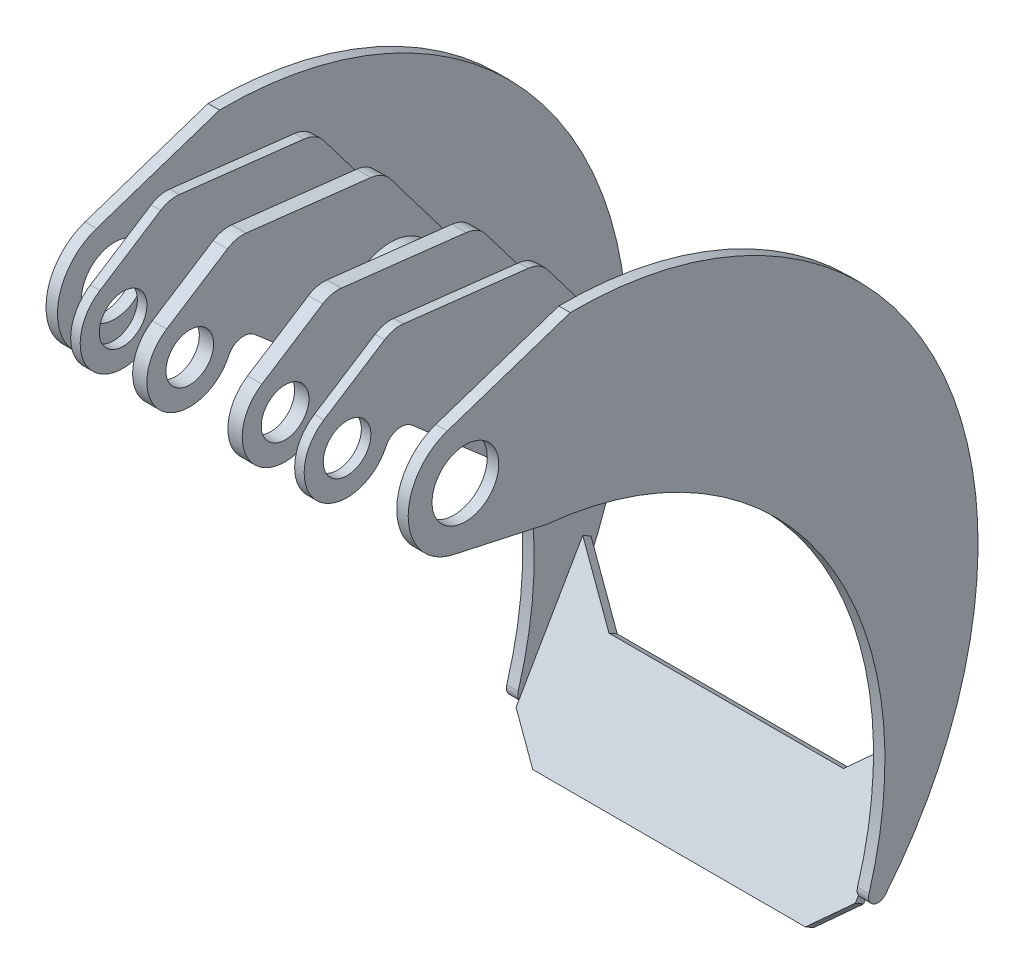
ISO-10303-21;
HEADER;
FILE_DESCRIPTION(('STEP AP214'),'2;1');
FILE_NAME('part.step','',(''),(''),'','','');
FILE_SCHEMA(('AUTOMOTIVE_DESIGN { 1 0 10303 214 1 1 1 1 }'));
ENDSEC;
DATA;
#1=APPLICATION_CONTEXT('core data for automotive mechanical design processes');
#2=APPLICATION_PROTOCOL_DEFINITION('international standard','automotive_design',2000,#1);
#3=PRODUCT_CONTEXT('',#1,'mechanical');
#4=PRODUCT('Part','Part','',(#3));
#5=PRODUCT_RELATED_PRODUCT_CATEGORY('part','',(#4));
#6=PRODUCT_DEFINITION_FORMATION('','',#4);
#7=PRODUCT_DEFINITION_CONTEXT('part definition',#1,'design');
#8=PRODUCT_DEFINITION('design','',#6,#7);
#9=PRODUCT_DEFINITION_SHAPE('','',#8);
#10=(LENGTH_UNIT() NAMED_UNIT(*) SI_UNIT(.MILLI.,.METRE.));
#11=(NAMED_UNIT(*) PLANE_ANGLE_UNIT() SI_UNIT($,.RADIAN.));
#12=(NAMED_UNIT(*) SI_UNIT($,.STERADIAN.) SOLID_ANGLE_UNIT());
#13=UNCERTAINTY_MEASURE_WITH_UNIT(LENGTH_MEASURE(1.E-05),#10,'distance_accuracy_value','');
#14=(GEOMETRIC_REPRESENTATION_CONTEXT(3) GLOBAL_UNCERTAINTY_ASSIGNED_CONTEXT((#13)) GLOBAL_UNIT_ASSIGNED_CONTEXT((#10,
#11,#12)) REPRESENTATION_CONTEXT('',''));
#15=CARTESIAN_POINT('',(0.,0.,0.));
#16=DIRECTION('',(0.,0.,1.));
#17=DIRECTION('',(1.,0.,0.));
#18=AXIS2_PLACEMENT_3D('',#15,#16,#17);
#19=CARTESIAN_POINT('',(380.002,-24.3091574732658,-153.824485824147));
#20=DIRECTION('',(-1.,0.,0.));
#21=DIRECTION('',(0.,0.,1.));
#22=AXIS2_PLACEMENT_3D('',#19,#20,#21);
#23=CYLINDRICAL_SURFACE('',#22,50.);
#24=CARTESIAN_POINT('',(12.,-24.3091574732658,-153.824485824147));
#25=DIRECTION('',(1.,0.,0.));
#26=DIRECTION('',(0.,0.,-1.));
#27=AXIS2_PLACEMENT_3D('',#24,#25,#26);
#28=CIRCLE('',#27,50.);
#29=CARTESIAN_POINT('',(12.,-24.3091574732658,-203.824485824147));
#30=VERTEX_POINT('',#29);
#31=EDGE_CURVE('E710',#30,#30,#28,.T.);
#32=ORIENTED_EDGE('',*,*,#31,.T.);
#33=EDGE_LOOP('',(#32));
#34=FACE_BOUND('',#33,.T.);
#35=CARTESIAN_POINT('',(67.5,-24.3091574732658,-153.824485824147));
#36=DIRECTION('',(1.,0.,0.));
#37=DIRECTION('',(0.,0.,-1.));
#38=AXIS2_PLACEMENT_3D('',#35,#36,#37);
#39=CIRCLE('',#38,50.);
#40=CARTESIAN_POINT('',(67.5,-24.3091574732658,-203.824485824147));
#41=VERTEX_POINT('',#40);
#42=EDGE_CURVE('E12',#41,#41,#39,.T.);
#43=ORIENTED_EDGE('',*,*,#42,.F.);
#44=EDGE_LOOP('',(#43));
#45=FACE_BOUND('',#44,.T.);
#46=ADVANCED_FACE('F41',(#34,#45),#23,.T.);
#47=CARTESIAN_POINT('',(77.5,-24.3091574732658,-153.824485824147));
#48=DIRECTION('',(-1.,0.,0.));
#49=DIRECTION('',(0.,0.,1.));
#50=AXIS2_PLACEMENT_3D('',#47,#48,#49);
#51=CIRCLE('',#50,50.);
#52=CARTESIAN_POINT('',(77.5,-24.3091574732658,-103.824485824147));
#53=VERTEX_POINT('',#52);
#54=EDGE_CURVE('E461',#53,#53,#51,.T.);
#55=ORIENTED_EDGE('',*,*,#54,.F.);
#56=EDGE_LOOP('',(#55));
#57=FACE_BOUND('',#56,.T.);
#58=CARTESIAN_POINT('',(132.5,-24.3091574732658,-153.824485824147));
#59=DIRECTION('',(1.,0.,0.));
#60=DIRECTION('',(0.,0.,-1.));
#61=AXIS2_PLACEMENT_3D('',#58,#59,#60);
#62=CIRCLE('',#61,50.);
#63=CARTESIAN_POINT('',(132.5,-24.3091574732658,-203.824485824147));
#64=VERTEX_POINT('',#63);
#65=EDGE_CURVE('E50',#64,#64,#62,.T.);
#66=ORIENTED_EDGE('',*,*,#65,.F.);
#67=EDGE_LOOP('',(#66));
#68=FACE_BOUND('',#67,.T.);
#69=ADVANCED_FACE('F916',(#57,#68),#23,.T.);
#70=CARTESIAN_POINT('',(368.,-24.3091574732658,-153.824485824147));
#71=DIRECTION('',(1.,0.,0.));
#72=DIRECTION('',(0.,0.,-1.));
#73=AXIS2_PLACEMENT_3D('',#70,#71,#72);
#74=CIRCLE('',#73,50.);
#75=CARTESIAN_POINT('',(368.,-24.3091574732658,-203.824485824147));
#76=VERTEX_POINT('',#75);
#77=EDGE_CURVE('E899',#76,#76,#74,.F.);
#78=ORIENTED_EDGE('',*,*,#77,.T.);
#79=EDGE_LOOP('',(#78));
#80=FACE_BOUND('',#79,.T.);
#81=CARTESIAN_POINT('',(312.5,-24.3091574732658,-153.824485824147));
#82=DIRECTION('',(-1.,0.,0.));
#83=DIRECTION('',(0.,0.,1.));
#84=AXIS2_PLACEMENT_3D('',#81,#82,#83);
#85=CIRCLE('',#84,50.);
#86=CARTESIAN_POINT('',(312.5,-24.3091574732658,-103.824485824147));
#87=VERTEX_POINT('',#86);
#88=EDGE_CURVE('E908',#87,#87,#85,.T.);
#89=ORIENTED_EDGE('',*,*,#88,.F.);
#90=EDGE_LOOP('',(#89));
#91=FACE_BOUND('',#90,.T.);
#92=ADVANCED_FACE('F918',(#80,#91),#23,.T.);
#93=CARTESIAN_POINT('',(302.5,-24.3091574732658,-153.824485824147));
#94=DIRECTION('',(-1.,0.,0.));
#95=DIRECTION('',(0.,0.,1.));
#96=AXIS2_PLACEMENT_3D('',#93,#94,#95);
#97=CIRCLE('',#96,50.);
#98=CARTESIAN_POINT('',(302.5,-24.3091574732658,-103.824485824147));
#99=VERTEX_POINT('',#98);
#100=EDGE_CURVE('E574',#99,#99,#97,.T.);
#101=ORIENTED_EDGE('',*,*,#100,.T.);
#102=EDGE_LOOP('',(#101));
#103=FACE_BOUND('',#102,.T.);
#104=CARTESIAN_POINT('',(247.5,-24.3091574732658,-153.824485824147));
#105=DIRECTION('',(-1.,0.,0.));
#106=DIRECTION('',(0.,0.,1.));
#107=AXIS2_PLACEMENT_3D('',#104,#105,#106);
#108=CIRCLE('',#107,50.);
#109=CARTESIAN_POINT('',(247.5,-24.3091574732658,-103.824485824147));
#110=VERTEX_POINT('',#109);
#111=EDGE_CURVE('E905',#110,#110,#108,.T.);
#112=ORIENTED_EDGE('',*,*,#111,.F.);
#113=EDGE_LOOP('',(#112));
#114=FACE_BOUND('',#113,.T.);
#115=ADVANCED_FACE('F925',(#103,#114),#23,.T.);
#116=CARTESIAN_POINT('',(368.,-633.51803870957,-412.330127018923));
#117=DIRECTION('',(0.,0.499999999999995,0.866025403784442));
#118=DIRECTION('',(0.,-0.866025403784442,0.499999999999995));
#119=AXIS2_PLACEMENT_3D('',#116,#117,#118);
#120=PLANE('',#119);
#121=DIRECTION('',(0.707106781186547,0.612372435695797,-0.35355339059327));
#122=VECTOR('',#121,1.);
#123=CARTESIAN_POINT('',(368.,-481.963593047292,-499.830127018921));
#124=LINE('',#123,#122);
#125=CARTESIAN_POINT('',(313.,-529.594990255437,-472.330127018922));
#126=VERTEX_POINT('',#125);
#127=CARTESIAN_POINT('',(368.,-481.963593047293,-499.830127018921));
#128=VERTEX_POINT('',#127);
#129=EDGE_CURVE('E731',#126,#128,#124,.T.);
#130=ORIENTED_EDGE('',*,*,#129,.T.);
#131=DIRECTION('',(0.,0.866025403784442,-0.499999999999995));
#132=VECTOR('',#131,1.);
#133=CARTESIAN_POINT('',(368.,-633.51803870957,-412.330127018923));
#134=LINE('',#133,#132);
#135=CARTESIAN_POINT('',(368.,-597.716768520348,-433.));
#136=VERTEX_POINT('',#135);
#137=EDGE_CURVE('E809',#136,#128,#134,.T.);
#138=ORIENTED_EDGE('',*,*,#137,.F.);
#139=CARTESIAN_POINT('',(368.,-603.207149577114,-429.830127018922));
#140=VERTEX_POINT('',#139);
#141=EDGE_CURVE('E806',#140,#136,#134,.T.);
#142=ORIENTED_EDGE('',*,*,#141,.F.);
#143=DIRECTION('',(0.70710678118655,0.612372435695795,-0.353553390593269));
#144=VECTOR('',#143,1.);
#145=CARTESIAN_POINT('',(368.000000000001,-603.207149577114,-429.830127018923));
#146=LINE('',#145,#144);
#147=CARTESIAN_POINT('',(333.,-633.51803870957,-412.330127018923));
#148=VERTEX_POINT('',#147);
#149=EDGE_CURVE('E888',#140,#148,#146,.F.);
#150=ORIENTED_EDGE('',*,*,#149,.T.);
#151=DIRECTION('',(-1.,0.,0.));
#152=VECTOR('',#151,1.);
#153=CARTESIAN_POINT('',(368.,-633.51803870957,-412.330127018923));
#154=LINE('',#153,#152);
#155=CARTESIAN_POINT('',(46.9999999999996,-633.51803870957,-412.330127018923));
#156=VERTEX_POINT('',#155);
#157=EDGE_CURVE('E827',#148,#156,#154,.T.);
#158=ORIENTED_EDGE('',*,*,#157,.T.);
#159=DIRECTION('',(-0.707106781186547,0.612372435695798,-0.35355339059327));
#160=VECTOR('',#159,1.);
#161=CARTESIAN_POINT('',(46.9999999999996,-633.51803870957,-412.330127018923));
#162=LINE('',#161,#160);
#163=CARTESIAN_POINT('',(12.,-603.207149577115,-429.830127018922));
#164=VERTEX_POINT('',#163);
#165=EDGE_CURVE('E890',#156,#164,#162,.T.);
#166=ORIENTED_EDGE('',*,*,#165,.T.);
#167=DIRECTION('',(0.,0.866025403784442,-0.499999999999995));
#168=VECTOR('',#167,1.);
#169=CARTESIAN_POINT('',(12.,-633.51803870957,-412.330127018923));
#170=LINE('',#169,#168);
#171=CARTESIAN_POINT('',(12.,-597.716768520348,-433.));
#172=VERTEX_POINT('',#171);
#173=EDGE_CURVE('E805',#164,#172,#170,.T.);
#174=ORIENTED_EDGE('',*,*,#173,.T.);
#175=CARTESIAN_POINT('',(12.,-481.963593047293,-499.830127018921));
#176=VERTEX_POINT('',#175);
#177=EDGE_CURVE('E819',#172,#176,#170,.T.);
#178=ORIENTED_EDGE('',*,*,#177,.T.);
#179=DIRECTION('',(0.707106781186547,-0.612372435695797,0.35355339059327));
#180=VECTOR('',#179,1.);
#181=CARTESIAN_POINT('',(66.9999999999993,-529.594990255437,-472.330127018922));
#182=LINE('',#181,#180);
#183=CARTESIAN_POINT('',(66.9999999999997,-529.594990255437,-472.330127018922));
#184=VERTEX_POINT('',#183);
#185=EDGE_CURVE('E738',#176,#184,#182,.T.);
#186=ORIENTED_EDGE('',*,*,#185,.T.);
#187=DIRECTION('',(1.,0.,0.));
#188=VECTOR('',#187,1.);
#189=CARTESIAN_POINT('',(313.,-529.594990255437,-472.330127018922));
#190=LINE('',#189,#188);
#191=EDGE_CURVE('E742',#184,#126,#190,.T.);
#192=ORIENTED_EDGE('',*,*,#191,.T.);
#193=EDGE_LOOP('',(#130,#138,#142,#150,#158,#166,#174,#178,#186,#192));
#194=FACE_BOUND('',#193,.T.);
#195=ADVANCED_FACE('F999',(#194),#120,.F.);
#196=CARTESIAN_POINT('',(368.,-628.51803870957,-403.669872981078));
#197=DIRECTION('',(0.,-0.499999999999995,-0.866025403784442));
#198=DIRECTION('',(0.,0.866025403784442,-0.499999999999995));
#199=AXIS2_PLACEMENT_3D('',#196,#197,#198);
#200=PLANE('',#199);
#201=DIRECTION('',(0.707106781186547,-0.612372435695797,0.35355339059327));
#202=VECTOR('',#201,1.);
#203=CARTESIAN_POINT('',(66.9999999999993,-524.594990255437,-463.669872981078));
#204=LINE('',#203,#202);
#205=CARTESIAN_POINT('',(12.,-476.963593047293,-491.169872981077));
#206=VERTEX_POINT('',#205);
#207=CARTESIAN_POINT('',(66.9999999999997,-524.594990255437,-463.669872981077));
#208=VERTEX_POINT('',#207);
#209=EDGE_CURVE('E736',#206,#208,#204,.T.);
#210=ORIENTED_EDGE('',*,*,#209,.F.);
#211=DIRECTION('',(0.,-0.866025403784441,0.499999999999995));
#212=VECTOR('',#211,1.);
#213=CARTESIAN_POINT('',(12.,-628.51803870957,-403.669872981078));
#214=LINE('',#213,#212);
#215=CARTESIAN_POINT('',(12.,-592.716768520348,-424.339745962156));
#216=VERTEX_POINT('',#215);
#217=EDGE_CURVE('E822',#206,#216,#214,.T.);
#218=ORIENTED_EDGE('',*,*,#217,.T.);
#219=CARTESIAN_POINT('',(12.,-598.207149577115,-421.169872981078));
#220=VERTEX_POINT('',#219);
#221=EDGE_CURVE('E821',#216,#220,#214,.T.);
#222=ORIENTED_EDGE('',*,*,#221,.T.);
#223=DIRECTION('',(0.707106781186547,-0.612372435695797,0.353553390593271));
#224=VECTOR('',#223,1.);
#225=CARTESIAN_POINT('',(46.9999999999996,-628.51803870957,-403.669872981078));
#226=LINE('',#225,#224);
#227=CARTESIAN_POINT('',(46.9999999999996,-628.51803870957,-403.669872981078));
#228=VERTEX_POINT('',#227);
#229=EDGE_CURVE('E894',#220,#228,#226,.T.);
#230=ORIENTED_EDGE('',*,*,#229,.T.);
#231=DIRECTION('',(-1.,0.,0.));
#232=VECTOR('',#231,1.);
#233=CARTESIAN_POINT('',(368.,-628.51803870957,-403.669872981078));
#234=LINE('',#233,#232);
#235=CARTESIAN_POINT('',(333.,-628.51803870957,-403.669872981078));
#236=VERTEX_POINT('',#235);
#237=EDGE_CURVE('E816',#236,#228,#234,.T.);
#238=ORIENTED_EDGE('',*,*,#237,.F.);
#239=DIRECTION('',(-0.70710678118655,-0.612372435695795,0.353553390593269));
#240=VECTOR('',#239,1.);
#241=CARTESIAN_POINT('',(368.,-598.207149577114,-421.169872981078));
#242=LINE('',#241,#240);
#243=CARTESIAN_POINT('',(368.,-598.207149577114,-421.169872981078));
#244=VERTEX_POINT('',#243);
#245=EDGE_CURVE('E57',#236,#244,#242,.F.);
#246=ORIENTED_EDGE('',*,*,#245,.T.);
#247=DIRECTION('',(0.,-0.866025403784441,0.499999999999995));
#248=VECTOR('',#247,1.);
#249=CARTESIAN_POINT('',(368.,-628.51803870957,-403.669872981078));
#250=LINE('',#249,#248);
#251=CARTESIAN_POINT('',(368.,-592.716768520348,-424.339745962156));
#252=VERTEX_POINT('',#251);
#253=EDGE_CURVE('E812',#252,#244,#250,.T.);
#254=ORIENTED_EDGE('',*,*,#253,.F.);
#255=CARTESIAN_POINT('',(368.,-476.963593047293,-491.169872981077));
#256=VERTEX_POINT('',#255);
#257=EDGE_CURVE('E813',#256,#252,#250,.T.);
#258=ORIENTED_EDGE('',*,*,#257,.F.);
#259=DIRECTION('',(0.707106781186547,0.612372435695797,-0.35355339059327));
#260=VECTOR('',#259,1.);
#261=CARTESIAN_POINT('',(368.,-476.963593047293,-491.169872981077));
#262=LINE('',#261,#260);
#263=CARTESIAN_POINT('',(313.,-524.594990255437,-463.669872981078));
#264=VERTEX_POINT('',#263);
#265=EDGE_CURVE('E732',#264,#256,#262,.T.);
#266=ORIENTED_EDGE('',*,*,#265,.F.);
#267=DIRECTION('',(1.,0.,0.));
#268=VECTOR('',#267,1.);
#269=CARTESIAN_POINT('',(313.,-524.594990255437,-463.669872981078));
#270=LINE('',#269,#268);
#271=EDGE_CURVE('E735',#208,#264,#270,.T.);
#272=ORIENTED_EDGE('',*,*,#271,.F.);
#273=EDGE_LOOP('',(#210,#218,#222,#230,#238,#246,#254,#258,#266,#272));
#274=FACE_BOUND('',#273,.T.);
#275=ADVANCED_FACE('F995',(#274),#200,.F.);
#276=CARTESIAN_POINT('',(12.,0.,0.));
#277=DIRECTION('',(1.,0.,0.));
#278=DIRECTION('',(0.,0.,-1.));
#279=AXIS2_PLACEMENT_3D('',#276,#277,#278);
#280=PLANE('',#279);
#281=ORIENTED_EDGE('',*,*,#31,.F.);
#282=EDGE_LOOP('',(#281));
#283=FACE_BOUND('',#282,.T.);
#284=ORIENTED_EDGE('',*,*,#217,.F.);
#285=DIRECTION('',(0.,0.499999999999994,0.866025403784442));
#286=VECTOR('',#285,1.);
#287=CARTESIAN_POINT('',(12.,-481.963593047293,-499.830127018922));
#288=LINE('',#287,#286);
#289=EDGE_CURVE('E818',#176,#206,#288,.T.);
#290=ORIENTED_EDGE('',*,*,#289,.F.);
#291=ORIENTED_EDGE('',*,*,#177,.F.);
#292=CARTESIAN_POINT('',(12.,-587.716768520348,-433.));
#293=DIRECTION('',(1.,0.,0.));
#294=DIRECTION('',(0.,0.,-1.));
#295=AXIS2_PLACEMENT_3D('',#292,#293,#294);
#296=CIRCLE('',#295,10.);
#297=CARTESIAN_POINT('',(12.,-594.087166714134,-440.70830894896));
#298=VERTEX_POINT('',#297);
#299=EDGE_CURVE('E845',#172,#298,#296,.T.);
#300=ORIENTED_EDGE('',*,*,#299,.T.);
#301=CARTESIAN_POINT('',(12.,-323.98228329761,-113.876009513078));
#302=DIRECTION('',(1.,0.,0.));
#303=DIRECTION('',(0.,0.,1.));
#304=AXIS2_PLACEMENT_3D('',#301,#302,#303);
#305=CIRCLE('',#304,424.);
#306=CARTESIAN_POINT('',(12.,100.,-110.));
#307=VERTEX_POINT('',#306);
#308=EDGE_CURVE('E849',#298,#307,#305,.T.);
#309=ORIENTED_EDGE('',*,*,#308,.T.);
#310=DIRECTION('',(0.,-0.316808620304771,0.948489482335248));
#311=VECTOR('',#310,1.);
#312=CARTESIAN_POINT('',(12.,56.9093689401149,19.0085172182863));
#313=LINE('',#312,#311);
#314=CARTESIAN_POINT('',(12.,56.9093689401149,19.0085172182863));
#315=VERTEX_POINT('',#314);
#316=EDGE_CURVE('E852',#307,#315,#313,.T.);
#317=ORIENTED_EDGE('',*,*,#316,.T.);
#318=CARTESIAN_POINT('',(12.,0.,0.));
#319=DIRECTION('',(1.,0.,0.));
#320=DIRECTION('',(0.,0.,-1.));
#321=AXIS2_PLACEMENT_3D('',#318,#319,#320);
#322=CIRCLE('',#321,60.);
#323=CARTESIAN_POINT('',(12.,-58.6155671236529,12.8146514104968));
#324=VERTEX_POINT('',#323);
#325=EDGE_CURVE('E837',#315,#324,#322,.T.);
#326=ORIENTED_EDGE('',*,*,#325,.T.);
#327=DIRECTION('',(0.,-0.21357752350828,-0.976926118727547));
#328=VECTOR('',#327,1.);
#329=CARTESIAN_POINT('',(12.,-80.,-85.));
#330=LINE('',#329,#328);
#331=CARTESIAN_POINT('',(12.,-80.,-85.0000000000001));
#332=VERTEX_POINT('',#331);
#333=EDGE_CURVE('E840',#324,#332,#330,.T.);
#334=ORIENTED_EDGE('',*,*,#333,.T.);
#335=CARTESIAN_POINT('',(12.,-471.179609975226,-47.217560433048));
#336=DIRECTION('',(-1.,0.,0.));
#337=DIRECTION('',(0.,0.,-1.));
#338=AXIS2_PLACEMENT_3D('',#335,#336,#337);
#339=CIRCLE('',#338,393.);
#340=CARTESIAN_POINT('',(12.,-584.825027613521,-423.4272347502));
#341=VERTEX_POINT('',#340);
#342=EDGE_CURVE('E843',#332,#341,#339,.T.);
#343=ORIENTED_EDGE('',*,*,#342,.T.);
#344=EDGE_CURVE('E846',#341,#216,#296,.T.);
#345=ORIENTED_EDGE('',*,*,#344,.T.);
#346=EDGE_LOOP('',(#284,#290,#291,#300,#309,#317,#326,#334,#343,#345));
#347=FACE_BOUND('',#346,.T.);
#348=CARTESIAN_POINT('',(12.,0.,0.));
#349=DIRECTION('',(1.,0.,0.));
#350=DIRECTION('',(0.,0.,-1.));
#351=AXIS2_PLACEMENT_3D('',#348,#349,#350);
#352=CIRCLE('',#351,35.);
#353=CARTESIAN_POINT('',(12.,0.,-35.));
#354=VERTEX_POINT('',#353);
#355=EDGE_CURVE('E831',#354,#354,#352,.T.);
#356=ORIENTED_EDGE('',*,*,#355,.F.);
#357=EDGE_LOOP('',(#356));
#358=FACE_BOUND('',#357,.T.);
#359=ADVANCED_FACE('F998',(#283,#347,#358),#280,.T.);
#360=CARTESIAN_POINT('',(0.,0.,0.));
#361=DIRECTION('',(1.,0.,0.));
#362=DIRECTION('',(0.,0.,-1.));
#363=AXIS2_PLACEMENT_3D('',#360,#361,#362);
#364=PLANE('',#363);
#365=CARTESIAN_POINT('',(0.,0.,0.));
#366=DIRECTION('',(1.,0.,0.));
#367=DIRECTION('',(0.,0.,-1.));
#368=AXIS2_PLACEMENT_3D('',#365,#366,#367);
#369=CIRCLE('',#368,60.);
#370=CARTESIAN_POINT('',(0.,56.9093689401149,19.0085172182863));
#371=VERTEX_POINT('',#370);
#372=CARTESIAN_POINT('',(0.,-58.6155671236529,12.8146514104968));
#373=VERTEX_POINT('',#372);
#374=EDGE_CURVE('E834',#371,#373,#369,.T.);
#375=ORIENTED_EDGE('',*,*,#374,.F.);
#376=DIRECTION('',(0.,-0.316808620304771,0.948489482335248));
#377=VECTOR('',#376,1.);
#378=CARTESIAN_POINT('',(0.,56.9093689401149,19.0085172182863));
#379=LINE('',#378,#377);
#380=CARTESIAN_POINT('',(0.,100.,-110.));
#381=VERTEX_POINT('',#380);
#382=EDGE_CURVE('E841',#381,#371,#379,.T.);
#383=ORIENTED_EDGE('',*,*,#382,.F.);
#384=CARTESIAN_POINT('',(0.,-323.98228329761,-113.876009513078));
#385=DIRECTION('',(1.,0.,0.));
#386=DIRECTION('',(0.,0.,1.));
#387=AXIS2_PLACEMENT_3D('',#384,#385,#386);
#388=CIRCLE('',#387,424.);
#389=CARTESIAN_POINT('',(0.,-594.087166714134,-440.70830894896));
#390=VERTEX_POINT('',#389);
#391=EDGE_CURVE('E863',#390,#381,#388,.T.);
#392=ORIENTED_EDGE('',*,*,#391,.F.);
#393=CARTESIAN_POINT('',(0.,-587.716768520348,-433.));
#394=DIRECTION('',(1.,0.,0.));
#395=DIRECTION('',(0.,0.,-1.));
#396=AXIS2_PLACEMENT_3D('',#393,#394,#395);
#397=CIRCLE('',#396,10.);
#398=CARTESIAN_POINT('',(0.,-584.825027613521,-423.4272347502));
#399=VERTEX_POINT('',#398);
#400=EDGE_CURVE('E861',#399,#390,#397,.T.);
#401=ORIENTED_EDGE('',*,*,#400,.F.);
#402=CARTESIAN_POINT('',(0.,-471.179609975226,-47.217560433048));
#403=DIRECTION('',(-1.,0.,0.));
#404=DIRECTION('',(0.,0.,-1.));
#405=AXIS2_PLACEMENT_3D('',#402,#403,#404);
#406=CIRCLE('',#405,393.);
#407=CARTESIAN_POINT('',(0.,-80.,-85.0000000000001));
#408=VERTEX_POINT('',#407);
#409=EDGE_CURVE('E859',#408,#399,#406,.T.);
#410=ORIENTED_EDGE('',*,*,#409,.F.);
#411=DIRECTION('',(0.,-0.21357752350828,-0.976926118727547));
#412=VECTOR('',#411,1.);
#413=CARTESIAN_POINT('',(0.,-80.,-85.));
#414=LINE('',#413,#412);
#415=EDGE_CURVE('E857',#373,#408,#414,.T.);
#416=ORIENTED_EDGE('',*,*,#415,.F.);
#417=EDGE_LOOP('',(#375,#383,#392,#401,#410,#416));
#418=FACE_BOUND('',#417,.T.);
#419=CARTESIAN_POINT('',(0.,0.,0.));
#420=DIRECTION('',(1.,0.,0.));
#421=DIRECTION('',(0.,0.,-1.));
#422=AXIS2_PLACEMENT_3D('',#419,#420,#421);
#423=CIRCLE('',#422,35.);
#424=CARTESIAN_POINT('',(0.,0.,-35.));
#425=VERTEX_POINT('',#424);
#426=EDGE_CURVE('E830',#425,#425,#423,.T.);
#427=ORIENTED_EDGE('',*,*,#426,.T.);
#428=EDGE_LOOP('',(#427));
#429=FACE_BOUND('',#428,.T.);
#430=ADVANCED_FACE('F1013',(#418,#429),#364,.F.);
#431=CARTESIAN_POINT('',(12.,0.,0.));
#432=DIRECTION('',(-1.,0.,0.));
#433=DIRECTION('',(0.,0.,1.));
#434=AXIS2_PLACEMENT_3D('',#431,#432,#433);
#435=CYLINDRICAL_SURFACE('',#434,60.);
#436=ORIENTED_EDGE('',*,*,#374,.T.);
#437=DIRECTION('',(-1.,0.,0.));
#438=VECTOR('',#437,1.);
#439=CARTESIAN_POINT('',(12.,-58.6155671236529,12.8146514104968));
#440=LINE('',#439,#438);
#441=EDGE_CURVE('E880',#324,#373,#440,.T.);
#442=ORIENTED_EDGE('',*,*,#441,.F.);
#443=ORIENTED_EDGE('',*,*,#325,.F.);
#444=DIRECTION('',(-1.,0.,0.));
#445=VECTOR('',#444,1.);
#446=CARTESIAN_POINT('',(12.,56.9093689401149,19.0085172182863));
#447=LINE('',#446,#445);
#448=EDGE_CURVE('E854',#315,#371,#447,.T.);
#449=ORIENTED_EDGE('',*,*,#448,.T.);
#450=EDGE_LOOP('',(#436,#442,#443,#449));
#451=FACE_BOUND('',#450,.T.);
#452=ADVANCED_FACE('F1018',(#451),#435,.T.);
#453=CARTESIAN_POINT('',(12.,-80.,-85.));
#454=DIRECTION('',(0.,0.976926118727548,-0.21357752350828));
#455=DIRECTION('',(0.,0.21357752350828,0.976926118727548));
#456=AXIS2_PLACEMENT_3D('',#453,#454,#455);
#457=PLANE('',#456);
#458=ORIENTED_EDGE('',*,*,#415,.T.);
#459=DIRECTION('',(-1.,0.,0.));
#460=VECTOR('',#459,1.);
#461=CARTESIAN_POINT('',(12.,-80.,-85.0000000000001));
#462=LINE('',#461,#460);
#463=EDGE_CURVE('E877',#332,#408,#462,.T.);
#464=ORIENTED_EDGE('',*,*,#463,.F.);
#465=ORIENTED_EDGE('',*,*,#333,.F.);
#466=ORIENTED_EDGE('',*,*,#441,.T.);
#467=EDGE_LOOP('',(#458,#464,#465,#466));
#468=FACE_BOUND('',#467,.T.);
#469=ADVANCED_FACE('F1034',(#468),#457,.F.);
#470=CARTESIAN_POINT('',(12.,-471.179609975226,-47.217560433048));
#471=DIRECTION('',(-1.,0.,0.));
#472=DIRECTION('',(0.,0.,1.));
#473=AXIS2_PLACEMENT_3D('',#470,#471,#472);
#474=CYLINDRICAL_SURFACE('',#473,393.);
#475=ORIENTED_EDGE('',*,*,#409,.T.);
#476=DIRECTION('',(-1.,0.,0.));
#477=VECTOR('',#476,1.);
#478=CARTESIAN_POINT('',(12.,-584.825027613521,-423.4272347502));
#479=LINE('',#478,#477);
#480=EDGE_CURVE('E874',#341,#399,#479,.T.);
#481=ORIENTED_EDGE('',*,*,#480,.F.);
#482=ORIENTED_EDGE('',*,*,#342,.F.);
#483=ORIENTED_EDGE('',*,*,#463,.T.);
#484=EDGE_LOOP('',(#475,#481,#482,#483));
#485=FACE_BOUND('',#484,.T.);
#486=ADVANCED_FACE('F1030',(#485),#474,.F.);
#487=CARTESIAN_POINT('',(12.,-587.716768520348,-433.));
#488=DIRECTION('',(-1.,0.,0.));
#489=DIRECTION('',(0.,0.,1.));
#490=AXIS2_PLACEMENT_3D('',#487,#488,#489);
#491=CYLINDRICAL_SURFACE('',#490,10.);
#492=ORIENTED_EDGE('',*,*,#400,.T.);
#493=DIRECTION('',(-1.,0.,0.));
#494=VECTOR('',#493,1.);
#495=CARTESIAN_POINT('',(12.,-594.087166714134,-440.70830894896));
#496=LINE('',#495,#494);
#497=EDGE_CURVE('E871',#298,#390,#496,.T.);
#498=ORIENTED_EDGE('',*,*,#497,.F.);
#499=ORIENTED_EDGE('',*,*,#299,.F.);
#500=EDGE_CURVE('E850',#216,#172,#296,.T.);
#501=ORIENTED_EDGE('',*,*,#500,.F.);
#502=ORIENTED_EDGE('',*,*,#344,.F.);
#503=ORIENTED_EDGE('',*,*,#480,.T.);
#504=EDGE_LOOP('',(#492,#498,#499,#501,#502,#503));
#505=FACE_BOUND('',#504,.T.);
#506=ADVANCED_FACE('F1026',(#505),#491,.T.);
#507=CARTESIAN_POINT('',(12.,-323.98228329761,-113.876009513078));
#508=DIRECTION('',(-1.,0.,0.));
#509=DIRECTION('',(0.,0.,1.));
#510=AXIS2_PLACEMENT_3D('',#507,#508,#509);
#511=CYLINDRICAL_SURFACE('',#510,424.);
#512=ORIENTED_EDGE('',*,*,#391,.T.);
#513=DIRECTION('',(-1.,0.,0.));
#514=VECTOR('',#513,1.);
#515=CARTESIAN_POINT('',(12.,100.,-110.));
#516=LINE('',#515,#514);
#517=EDGE_CURVE('E868',#307,#381,#516,.T.);
#518=ORIENTED_EDGE('',*,*,#517,.F.);
#519=ORIENTED_EDGE('',*,*,#308,.F.);
#520=ORIENTED_EDGE('',*,*,#497,.T.);
#521=EDGE_LOOP('',(#512,#518,#519,#520));
#522=FACE_BOUND('',#521,.T.);
#523=ADVANCED_FACE('F1022',(#522),#511,.T.);
#524=CARTESIAN_POINT('',(12.,56.9093689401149,19.0085172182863));
#525=DIRECTION('',(0.,-0.948489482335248,-0.316808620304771));
#526=DIRECTION('',(0.,0.316808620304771,-0.948489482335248));
#527=AXIS2_PLACEMENT_3D('',#524,#525,#526);
#528=PLANE('',#527);
#529=ORIENTED_EDGE('',*,*,#382,.T.);
#530=ORIENTED_EDGE('',*,*,#448,.F.);
#531=ORIENTED_EDGE('',*,*,#316,.F.);
#532=ORIENTED_EDGE('',*,*,#517,.T.);
#533=EDGE_LOOP('',(#529,#530,#531,#532));
#534=FACE_BOUND('',#533,.T.);
#535=ADVANCED_FACE('F1009',(#534),#528,.F.);
#536=CARTESIAN_POINT('',(12.,0.,0.));
#537=DIRECTION('',(-1.,0.,0.));
#538=DIRECTION('',(0.,0.,1.));
#539=AXIS2_PLACEMENT_3D('',#536,#537,#538);
#540=CYLINDRICAL_SURFACE('',#539,35.);
#541=ORIENTED_EDGE('',*,*,#355,.T.);
#542=EDGE_LOOP('',(#541));
#543=FACE_BOUND('',#542,.T.);
#544=ORIENTED_EDGE('',*,*,#426,.F.);
#545=EDGE_LOOP('',(#544));
#546=FACE_BOUND('',#545,.T.);
#547=ADVANCED_FACE('F1005',(#543,#546),#540,.F.);
#548=CARTESIAN_POINT('',(368.,-633.51803870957,-412.330127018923));
#549=DIRECTION('',(0.,0.866025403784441,-0.499999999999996));
#550=DIRECTION('',(0.,0.499999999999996,0.866025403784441));
#551=AXIS2_PLACEMENT_3D('',#548,#549,#550);
#552=PLANE('',#551);
#553=ORIENTED_EDGE('',*,*,#237,.T.);
#554=DIRECTION('',(0.,-0.499999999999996,-0.866025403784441));
#555=VECTOR('',#554,1.);
#556=CARTESIAN_POINT('',(46.9999999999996,-633.51803870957,-412.330127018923));
#557=LINE('',#556,#555);
#558=EDGE_CURVE('E885',#228,#156,#557,.T.);
#559=ORIENTED_EDGE('',*,*,#558,.T.);
#560=ORIENTED_EDGE('',*,*,#157,.F.);
#561=DIRECTION('',(0.,0.499999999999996,0.866025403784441));
#562=VECTOR('',#561,1.);
#563=CARTESIAN_POINT('',(333.,-633.51803870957,-412.330127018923));
#564=LINE('',#563,#562);
#565=EDGE_CURVE('E883',#148,#236,#564,.T.);
#566=ORIENTED_EDGE('',*,*,#565,.T.);
#567=EDGE_LOOP('',(#553,#559,#560,#566));
#568=FACE_BOUND('',#567,.T.);
#569=ADVANCED_FACE('F991',(#568),#552,.F.);
#570=CARTESIAN_POINT('',(368.,0.,0.));
#571=DIRECTION('',(-1.,0.,0.));
#572=DIRECTION('',(0.,0.,1.));
#573=AXIS2_PLACEMENT_3D('',#570,#571,#572);
#574=PLANE('',#573);
#575=ORIENTED_EDGE('',*,*,#253,.T.);
#576=DIRECTION('',(0.,-0.499999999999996,-0.866025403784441));
#577=VECTOR('',#576,1.);
#578=CARTESIAN_POINT('',(368.,-266.2834575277,153.73882588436));
#579=LINE('',#578,#577);
#580=EDGE_CURVE('E896',#244,#140,#579,.T.);
#581=ORIENTED_EDGE('',*,*,#580,.T.);
#582=ORIENTED_EDGE('',*,*,#141,.T.);
#583=CARTESIAN_POINT('',(368.,-587.716768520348,-433.));
#584=DIRECTION('',(1.,0.,0.));
#585=DIRECTION('',(0.,0.,-1.));
#586=AXIS2_PLACEMENT_3D('',#583,#584,#585);
#587=CIRCLE('',#586,9.99999999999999);
#588=EDGE_CURVE('E787',#252,#136,#587,.T.);
#589=ORIENTED_EDGE('',*,*,#588,.F.);
#590=EDGE_LOOP('',(#575,#581,#582,#589));
#591=FACE_BOUND('',#590,.T.);
#592=ADVANCED_FACE('F988',(#591),#574,.F.);
#593=CARTESIAN_POINT('',(12.,0.,0.));
#594=DIRECTION('',(-1.,0.,0.));
#595=DIRECTION('',(0.,0.,1.));
#596=AXIS2_PLACEMENT_3D('',#593,#594,#595);
#597=PLANE('',#596);
#598=ORIENTED_EDGE('',*,*,#173,.F.);
#599=DIRECTION('',(0.,0.499999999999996,0.866025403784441));
#600=VECTOR('',#599,1.);
#601=CARTESIAN_POINT('',(12.,-598.207149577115,-421.169872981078));
#602=LINE('',#601,#600);
#603=EDGE_CURVE('E65',#164,#220,#602,.T.);
#604=ORIENTED_EDGE('',*,*,#603,.T.);
#605=ORIENTED_EDGE('',*,*,#221,.F.);
#606=ORIENTED_EDGE('',*,*,#500,.T.);
#607=EDGE_LOOP('',(#598,#604,#605,#606));
#608=FACE_BOUND('',#607,.T.);
#609=ADVANCED_FACE('F963',(#608),#597,.T.);
#610=CARTESIAN_POINT('',(368.,-323.98228329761,-113.876009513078));
#611=DIRECTION('',(1.,0.,0.));
#612=DIRECTION('',(0.,0.,-1.));
#613=AXIS2_PLACEMENT_3D('',#610,#611,#612);
#614=PLANE('',#613);
#615=ORIENTED_EDGE('',*,*,#77,.F.);
#616=EDGE_LOOP('',(#615));
#617=FACE_BOUND('',#616,.T.);
#618=CARTESIAN_POINT('',(368.,0.,0.));
#619=DIRECTION('',(1.,0.,0.));
#620=DIRECTION('',(0.,0.,-1.));
#621=AXIS2_PLACEMENT_3D('',#618,#619,#620);
#622=CIRCLE('',#621,35.);
#623=CARTESIAN_POINT('',(368.,0.,-35.));
#624=VERTEX_POINT('',#623);
#625=EDGE_CURVE('E752',#624,#624,#622,.T.);
#626=ORIENTED_EDGE('',*,*,#625,.T.);
#627=EDGE_LOOP('',(#626));
#628=FACE_BOUND('',#627,.T.);
#629=CARTESIAN_POINT('',(368.,-594.087166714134,-440.70830894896));
#630=VERTEX_POINT('',#629);
#631=EDGE_CURVE('E784',#136,#630,#587,.T.);
#632=ORIENTED_EDGE('',*,*,#631,.F.);
#633=ORIENTED_EDGE('',*,*,#137,.T.);
#634=DIRECTION('',(0.,0.499999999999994,0.866025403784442));
#635=VECTOR('',#634,1.);
#636=CARTESIAN_POINT('',(368.,-481.963593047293,-499.830127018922));
#637=LINE('',#636,#635);
#638=EDGE_CURVE('E808',#128,#256,#637,.T.);
#639=ORIENTED_EDGE('',*,*,#638,.T.);
#640=ORIENTED_EDGE('',*,*,#257,.T.);
#641=CARTESIAN_POINT('',(368.,-584.825027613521,-423.4272347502));
#642=VERTEX_POINT('',#641);
#643=EDGE_CURVE('E763',#642,#252,#587,.T.);
#644=ORIENTED_EDGE('',*,*,#643,.F.);
#645=CARTESIAN_POINT('',(368.,-471.179609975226,-47.217560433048));
#646=DIRECTION('',(-1.,0.,0.));
#647=DIRECTION('',(0.,0.,-1.));
#648=AXIS2_PLACEMENT_3D('',#645,#646,#647);
#649=CIRCLE('',#648,393.);
#650=CARTESIAN_POINT('',(368.,-80.,-85.0000000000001));
#651=VERTEX_POINT('',#650);
#652=EDGE_CURVE('E782',#651,#642,#649,.T.);
#653=ORIENTED_EDGE('',*,*,#652,.F.);
#654=DIRECTION('',(0.,-0.21357752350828,-0.976926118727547));
#655=VECTOR('',#654,1.);
#656=CARTESIAN_POINT('',(368.,-58.6155671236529,12.8146514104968));
#657=LINE('',#656,#655);
#658=CARTESIAN_POINT('',(368.,-58.6155671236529,12.8146514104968));
#659=VERTEX_POINT('',#658);
#660=EDGE_CURVE('E780',#659,#651,#657,.T.);
#661=ORIENTED_EDGE('',*,*,#660,.F.);
#662=CARTESIAN_POINT('',(368.,0.,0.));
#663=DIRECTION('',(1.,0.,0.));
#664=DIRECTION('',(0.,0.,-1.));
#665=AXIS2_PLACEMENT_3D('',#662,#663,#664);
#666=CIRCLE('',#665,60.);
#667=CARTESIAN_POINT('',(368.,56.9093689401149,19.0085172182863));
#668=VERTEX_POINT('',#667);
#669=EDGE_CURVE('E778',#668,#659,#666,.T.);
#670=ORIENTED_EDGE('',*,*,#669,.F.);
#671=DIRECTION('',(0.,-0.316808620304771,0.948489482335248));
#672=VECTOR('',#671,1.);
#673=CARTESIAN_POINT('',(368.,100.,-110.));
#674=LINE('',#673,#672);
#675=CARTESIAN_POINT('',(368.,100.,-110.));
#676=VERTEX_POINT('',#675);
#677=EDGE_CURVE('E776',#676,#668,#674,.T.);
#678=ORIENTED_EDGE('',*,*,#677,.F.);
#679=CARTESIAN_POINT('',(368.,-323.98228329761,-113.876009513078));
#680=DIRECTION('',(1.,0.,0.));
#681=DIRECTION('',(0.,0.,-1.));
#682=AXIS2_PLACEMENT_3D('',#679,#680,#681);
#683=CIRCLE('',#682,424.);
#684=EDGE_CURVE('E756',#630,#676,#683,.T.);
#685=ORIENTED_EDGE('',*,*,#684,.F.);
#686=EDGE_LOOP('',(#632,#633,#639,#640,#644,#653,#661,#670,#678,#685));
#687=FACE_BOUND('',#686,.T.);
#688=ADVANCED_FACE('F959',(#617,#628,#687),#614,.F.);
#689=CARTESIAN_POINT('',(380.,-323.98228329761,-113.876009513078));
#690=DIRECTION('',(1.,0.,0.));
#691=DIRECTION('',(0.,0.,-1.));
#692=AXIS2_PLACEMENT_3D('',#689,#690,#691);
#693=PLANE('',#692);
#694=CARTESIAN_POINT('',(380.,-323.98228329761,-113.876009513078));
#695=DIRECTION('',(1.,0.,0.));
#696=DIRECTION('',(0.,0.,-1.));
#697=AXIS2_PLACEMENT_3D('',#694,#695,#696);
#698=CIRCLE('',#697,424.);
#699=CARTESIAN_POINT('',(380.,-594.087166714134,-440.70830894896));
#700=VERTEX_POINT('',#699);
#701=CARTESIAN_POINT('',(380.,100.,-110.));
#702=VERTEX_POINT('',#701);
#703=EDGE_CURVE('E759',#700,#702,#698,.T.);
#704=ORIENTED_EDGE('',*,*,#703,.T.);
#705=DIRECTION('',(0.,-0.316808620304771,0.948489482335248));
#706=VECTOR('',#705,1.);
#707=CARTESIAN_POINT('',(380.,100.,-110.));
#708=LINE('',#707,#706);
#709=CARTESIAN_POINT('',(380.,56.9093689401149,19.0085172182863));
#710=VERTEX_POINT('',#709);
#711=EDGE_CURVE('E762',#702,#710,#708,.T.);
#712=ORIENTED_EDGE('',*,*,#711,.T.);
#713=CARTESIAN_POINT('',(380.,0.,0.));
#714=DIRECTION('',(1.,0.,0.));
#715=DIRECTION('',(0.,0.,-1.));
#716=AXIS2_PLACEMENT_3D('',#713,#714,#715);
#717=CIRCLE('',#716,60.);
#718=CARTESIAN_POINT('',(380.,-58.6155671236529,12.8146514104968));
#719=VERTEX_POINT('',#718);
#720=EDGE_CURVE('E765',#710,#719,#717,.T.);
#721=ORIENTED_EDGE('',*,*,#720,.T.);
#722=DIRECTION('',(0.,-0.21357752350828,-0.976926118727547));
#723=VECTOR('',#722,1.);
#724=CARTESIAN_POINT('',(380.,-58.6155671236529,12.8146514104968));
#725=LINE('',#724,#723);
#726=CARTESIAN_POINT('',(380.,-80.,-85.0000000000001));
#727=VERTEX_POINT('',#726);
#728=EDGE_CURVE('E767',#719,#727,#725,.T.);
#729=ORIENTED_EDGE('',*,*,#728,.T.);
#730=CARTESIAN_POINT('',(380.,-471.179609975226,-47.217560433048));
#731=DIRECTION('',(-1.,0.,0.));
#732=DIRECTION('',(0.,0.,-1.));
#733=AXIS2_PLACEMENT_3D('',#730,#731,#732);
#734=CIRCLE('',#733,393.);
#735=CARTESIAN_POINT('',(380.,-584.825027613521,-423.4272347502));
#736=VERTEX_POINT('',#735);
#737=EDGE_CURVE('E769',#727,#736,#734,.T.);
#738=ORIENTED_EDGE('',*,*,#737,.T.);
#739=CARTESIAN_POINT('',(380.,-587.716768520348,-433.));
#740=DIRECTION('',(1.,0.,0.));
#741=DIRECTION('',(0.,0.,-1.));
#742=AXIS2_PLACEMENT_3D('',#739,#740,#741);
#743=CIRCLE('',#742,9.99999999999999);
#744=EDGE_CURVE('E771',#736,#700,#743,.T.);
#745=ORIENTED_EDGE('',*,*,#744,.T.);
#746=EDGE_LOOP('',(#704,#712,#721,#729,#738,#745));
#747=FACE_BOUND('',#746,.T.);
#748=CARTESIAN_POINT('',(380.,0.,0.));
#749=DIRECTION('',(1.,0.,0.));
#750=DIRECTION('',(0.,0.,-1.));
#751=AXIS2_PLACEMENT_3D('',#748,#749,#750);
#752=CIRCLE('',#751,35.);
#753=CARTESIAN_POINT('',(380.,0.,-35.));
#754=VERTEX_POINT('',#753);
#755=EDGE_CURVE('E753',#754,#754,#752,.T.);
#756=ORIENTED_EDGE('',*,*,#755,.F.);
#757=EDGE_LOOP('',(#756));
#758=FACE_BOUND('',#757,.T.);
#759=ADVANCED_FACE('F955',(#747,#758),#693,.T.);
#760=CARTESIAN_POINT('',(380.,-323.98228329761,-113.876009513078));
#761=DIRECTION('',(-1.,0.,0.));
#762=DIRECTION('',(0.,0.,1.));
#763=AXIS2_PLACEMENT_3D('',#760,#761,#762);
#764=CYLINDRICAL_SURFACE('',#763,424.);
#765=ORIENTED_EDGE('',*,*,#684,.T.);
#766=DIRECTION('',(-1.,0.,0.));
#767=VECTOR('',#766,1.);
#768=CARTESIAN_POINT('',(380.,100.,-110.));
#769=LINE('',#768,#767);
#770=EDGE_CURVE('E802',#702,#676,#769,.T.);
#771=ORIENTED_EDGE('',*,*,#770,.F.);
#772=ORIENTED_EDGE('',*,*,#703,.F.);
#773=DIRECTION('',(-1.,0.,0.));
#774=VECTOR('',#773,1.);
#775=CARTESIAN_POINT('',(380.,-594.087166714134,-440.70830894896));
#776=LINE('',#775,#774);
#777=EDGE_CURVE('E773',#700,#630,#776,.T.);
#778=ORIENTED_EDGE('',*,*,#777,.T.);
#779=EDGE_LOOP('',(#765,#771,#772,#778));
#780=FACE_BOUND('',#779,.T.);
#781=ADVANCED_FACE('F958',(#780),#764,.T.);
#782=CARTESIAN_POINT('',(380.,100.,-110.));
#783=DIRECTION('',(0.,-0.948489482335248,-0.316808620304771));
#784=DIRECTION('',(0.,0.316808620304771,-0.948489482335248));
#785=AXIS2_PLACEMENT_3D('',#782,#783,#784);
#786=PLANE('',#785);
#787=ORIENTED_EDGE('',*,*,#677,.T.);
#788=DIRECTION('',(-1.,0.,0.));
#789=VECTOR('',#788,1.);
#790=CARTESIAN_POINT('',(380.,56.9093689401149,19.0085172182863));
#791=LINE('',#790,#789);
#792=EDGE_CURVE('E799',#710,#668,#791,.T.);
#793=ORIENTED_EDGE('',*,*,#792,.F.);
#794=ORIENTED_EDGE('',*,*,#711,.F.);
#795=ORIENTED_EDGE('',*,*,#770,.T.);
#796=EDGE_LOOP('',(#787,#793,#794,#795));
#797=FACE_BOUND('',#796,.T.);
#798=ADVANCED_FACE('F980',(#797),#786,.F.);
#799=CARTESIAN_POINT('',(380.,0.,0.));
#800=DIRECTION('',(-1.,0.,0.));
#801=DIRECTION('',(0.,0.,1.));
#802=AXIS2_PLACEMENT_3D('',#799,#800,#801);
#803=CYLINDRICAL_SURFACE('',#802,60.);
#804=ORIENTED_EDGE('',*,*,#669,.T.);
#805=DIRECTION('',(-1.,0.,0.));
#806=VECTOR('',#805,1.);
#807=CARTESIAN_POINT('',(380.,-58.6155671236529,12.8146514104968));
#808=LINE('',#807,#806);
#809=EDGE_CURVE('E796',#719,#659,#808,.T.);
#810=ORIENTED_EDGE('',*,*,#809,.F.);
#811=ORIENTED_EDGE('',*,*,#720,.F.);
#812=ORIENTED_EDGE('',*,*,#792,.T.);
#813=EDGE_LOOP('',(#804,#810,#811,#812));
#814=FACE_BOUND('',#813,.T.);
#815=ADVANCED_FACE('F976',(#814),#803,.T.);
#816=CARTESIAN_POINT('',(380.,-58.6155671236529,12.8146514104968));
#817=DIRECTION('',(0.,0.976926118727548,-0.21357752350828));
#818=DIRECTION('',(0.,0.21357752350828,0.976926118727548));
#819=AXIS2_PLACEMENT_3D('',#816,#817,#818);
#820=PLANE('',#819);
#821=ORIENTED_EDGE('',*,*,#660,.T.);
#822=DIRECTION('',(-1.,0.,0.));
#823=VECTOR('',#822,1.);
#824=CARTESIAN_POINT('',(380.,-80.,-85.0000000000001));
#825=LINE('',#824,#823);
#826=EDGE_CURVE('E793',#727,#651,#825,.T.);
#827=ORIENTED_EDGE('',*,*,#826,.F.);
#828=ORIENTED_EDGE('',*,*,#728,.F.);
#829=ORIENTED_EDGE('',*,*,#809,.T.);
#830=EDGE_LOOP('',(#821,#827,#828,#829));
#831=FACE_BOUND('',#830,.T.);
#832=ADVANCED_FACE('F972',(#831),#820,.F.);
#833=CARTESIAN_POINT('',(380.,-471.179609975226,-47.217560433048));
#834=DIRECTION('',(-1.,0.,0.));
#835=DIRECTION('',(0.,0.,1.));
#836=AXIS2_PLACEMENT_3D('',#833,#834,#835);
#837=CYLINDRICAL_SURFACE('',#836,393.);
#838=ORIENTED_EDGE('',*,*,#652,.T.);
#839=DIRECTION('',(-1.,0.,0.));
#840=VECTOR('',#839,1.);
#841=CARTESIAN_POINT('',(380.,-584.825027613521,-423.4272347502));
#842=LINE('',#841,#840);
#843=EDGE_CURVE('E790',#736,#642,#842,.T.);
#844=ORIENTED_EDGE('',*,*,#843,.F.);
#845=ORIENTED_EDGE('',*,*,#737,.F.);
#846=ORIENTED_EDGE('',*,*,#826,.T.);
#847=EDGE_LOOP('',(#838,#844,#845,#846));
#848=FACE_BOUND('',#847,.T.);
#849=ADVANCED_FACE('F968',(#848),#837,.F.);
#850=CARTESIAN_POINT('',(380.,-587.716768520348,-433.));
#851=DIRECTION('',(-1.,0.,0.));
#852=DIRECTION('',(0.,0.,1.));
#853=AXIS2_PLACEMENT_3D('',#850,#851,#852);
#854=CYLINDRICAL_SURFACE('',#853,9.99999999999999);
#855=ORIENTED_EDGE('',*,*,#643,.T.);
#856=ORIENTED_EDGE('',*,*,#588,.T.);
#857=ORIENTED_EDGE('',*,*,#631,.T.);
#858=ORIENTED_EDGE('',*,*,#777,.F.);
#859=ORIENTED_EDGE('',*,*,#744,.F.);
#860=ORIENTED_EDGE('',*,*,#843,.T.);
#861=EDGE_LOOP('',(#855,#856,#857,#858,#859,#860));
#862=FACE_BOUND('',#861,.T.);
#863=ADVANCED_FACE('F953',(#862),#854,.T.);
#864=CARTESIAN_POINT('',(380.,0.,0.));
#865=DIRECTION('',(-1.,0.,0.));
#866=DIRECTION('',(0.,0.,1.));
#867=AXIS2_PLACEMENT_3D('',#864,#865,#866);
#868=CYLINDRICAL_SURFACE('',#867,35.);
#869=ORIENTED_EDGE('',*,*,#755,.T.);
#870=EDGE_LOOP('',(#869));
#871=FACE_BOUND('',#870,.T.);
#872=ORIENTED_EDGE('',*,*,#625,.F.);
#873=EDGE_LOOP('',(#872));
#874=FACE_BOUND('',#873,.T.);
#875=ADVANCED_FACE('F949',(#871,#874),#868,.F.);
#876=CARTESIAN_POINT('',(46.9999999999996,-633.51803870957,-412.330127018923));
#877=DIRECTION('',(-0.707106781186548,-0.612372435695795,0.353553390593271));
#878=DIRECTION('',(0.,0.499999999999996,0.866025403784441));
#879=AXIS2_PLACEMENT_3D('',#876,#877,#878);
#880=PLANE('',#879);
#881=ORIENTED_EDGE('',*,*,#229,.F.);
#882=ORIENTED_EDGE('',*,*,#603,.F.);
#883=ORIENTED_EDGE('',*,*,#165,.F.);
#884=ORIENTED_EDGE('',*,*,#558,.F.);
#885=EDGE_LOOP('',(#881,#882,#883,#884));
#886=FACE_BOUND('',#885,.T.);
#887=ADVANCED_FACE('F952',(#886),#880,.T.);
#888=CARTESIAN_POINT('',(368.,-266.2834575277,153.73882588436));
#889=DIRECTION('',(-0.707106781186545,0.612372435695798,-0.353553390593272));
#890=DIRECTION('',(0.,-0.499999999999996,-0.866025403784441));
#891=AXIS2_PLACEMENT_3D('',#888,#889,#890);
#892=PLANE('',#891);
#893=ORIENTED_EDGE('',*,*,#245,.F.);
#894=ORIENTED_EDGE('',*,*,#565,.F.);
#895=ORIENTED_EDGE('',*,*,#149,.F.);
#896=ORIENTED_EDGE('',*,*,#580,.F.);
#897=EDGE_LOOP('',(#893,#894,#895,#896));
#898=FACE_BOUND('',#897,.T.);
#899=ADVANCED_FACE('F43',(#898),#892,.F.);
#900=CARTESIAN_POINT('',(368.,-1125.56971260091,-1614.58862614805));
#901=DIRECTION('',(-0.707106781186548,0.612372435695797,-0.353553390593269));
#902=DIRECTION('',(-0.654653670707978,-0.755928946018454,0.));
#903=AXIS2_PLACEMENT_3D('',#900,#901,#902);
#904=PLANE('',#903);
#905=ORIENTED_EDGE('',*,*,#129,.F.);
#906=DIRECTION('',(0.,0.499999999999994,0.866025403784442));
#907=VECTOR('',#906,1.);
#908=CARTESIAN_POINT('',(313.,-1173.20110980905,-1587.08862614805));
#909=LINE('',#908,#907);
#910=EDGE_CURVE('E749',#126,#264,#909,.T.);
#911=ORIENTED_EDGE('',*,*,#910,.T.);
#912=ORIENTED_EDGE('',*,*,#265,.T.);
#913=ORIENTED_EDGE('',*,*,#638,.F.);
#914=EDGE_LOOP('',(#905,#911,#912,#913));
#915=FACE_BOUND('',#914,.T.);
#916=ADVANCED_FACE('F944',(#915),#904,.T.);
#917=CARTESIAN_POINT('',(313.,-1173.20110980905,-1587.08862614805));
#918=DIRECTION('',(0.,0.866025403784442,-0.499999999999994));
#919=DIRECTION('',(0.,0.499999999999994,0.866025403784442));
#920=AXIS2_PLACEMENT_3D('',#917,#918,#919);
#921=PLANE('',#920);
#922=ORIENTED_EDGE('',*,*,#191,.F.);
#923=DIRECTION('',(0.,0.499999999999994,0.866025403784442));
#924=VECTOR('',#923,1.);
#925=CARTESIAN_POINT('',(66.9999999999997,-1173.20110980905,-1587.08862614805));
#926=LINE('',#925,#924);
#927=EDGE_CURVE('E734',#184,#208,#926,.T.);
#928=ORIENTED_EDGE('',*,*,#927,.T.);
#929=ORIENTED_EDGE('',*,*,#271,.T.);
#930=ORIENTED_EDGE('',*,*,#910,.F.);
#931=EDGE_LOOP('',(#922,#928,#929,#930));
#932=FACE_BOUND('',#931,.T.);
#933=ADVANCED_FACE('F940',(#932),#921,.T.);
#934=CARTESIAN_POINT('',(66.9999999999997,-1173.20110980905,-1587.08862614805));
#935=DIRECTION('',(0.707106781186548,0.612372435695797,-0.353553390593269));
#936=DIRECTION('',(-0.654653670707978,0.755928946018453,0.));
#937=AXIS2_PLACEMENT_3D('',#934,#935,#936);
#938=PLANE('',#937);
#939=ORIENTED_EDGE('',*,*,#185,.F.);
#940=ORIENTED_EDGE('',*,*,#289,.T.);
#941=ORIENTED_EDGE('',*,*,#209,.T.);
#942=ORIENTED_EDGE('',*,*,#927,.F.);
#943=EDGE_LOOP('',(#939,#940,#941,#942));
#944=FACE_BOUND('',#943,.T.);
#945=ADVANCED_FACE('F934',(#944),#938,.T.);
#946=CARTESIAN_POINT('',(147.5,-24.3091574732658,-153.824485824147));
#947=DIRECTION('',(1.,0.,0.));
#948=DIRECTION('',(0.,0.,-1.));
#949=AXIS2_PLACEMENT_3D('',#946,#947,#948);
#950=CIRCLE('',#949,50.);
#951=CARTESIAN_POINT('',(147.5,-24.3091574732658,-203.824485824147));
#952=VERTEX_POINT('',#951);
#953=EDGE_CURVE('E500',#952,#952,#950,.T.);
#954=ORIENTED_EDGE('',*,*,#953,.T.);
#955=EDGE_LOOP('',(#954));
#956=FACE_BOUND('',#955,.T.);
#957=CARTESIAN_POINT('',(232.5,-24.3091574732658,-153.824485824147));
#958=DIRECTION('',(1.,0.,0.));
#959=DIRECTION('',(0.,0.,-1.));
#960=AXIS2_PLACEMENT_3D('',#957,#958,#959);
#961=CIRCLE('',#960,50.);
#962=CARTESIAN_POINT('',(232.5,-24.3091574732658,-203.824485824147));
#963=VERTEX_POINT('',#962);
#964=EDGE_CURVE('E648',#963,#963,#961,.T.);
#965=ORIENTED_EDGE('',*,*,#964,.F.);
#966=EDGE_LOOP('',(#965));
#967=FACE_BOUND('',#966,.T.);
#968=ADVANCED_FACE('F928',(#956,#967),#23,.T.);
#969=CARTESIAN_POINT('',(232.5,0.,0.));
#970=DIRECTION('',(1.,0.,0.));
#971=DIRECTION('',(0.,0.,-1.));
#972=AXIS2_PLACEMENT_3D('',#969,#970,#971);
#973=CYLINDRICAL_SURFACE('',#972,17.5);
#974=CARTESIAN_POINT('',(247.5,0.,0.));
#975=DIRECTION('',(-1.,0.,0.));
#976=DIRECTION('',(0.,0.,1.));
#977=AXIS2_PLACEMENT_3D('',#974,#975,#976);
#978=CIRCLE('',#977,17.5);
#979=CARTESIAN_POINT('',(247.5,7.3958195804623,15.8603862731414));
#980=VERTEX_POINT('',#979);
#981=CARTESIAN_POINT('',(247.5,13.2136393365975,-11.4738718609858));
#982=VERTEX_POINT('',#981);
#983=EDGE_CURVE('E653',#980,#982,#978,.T.);
#984=ORIENTED_EDGE('',*,*,#983,.F.);
#985=DIRECTION('',(1.,0.,0.));
#986=VECTOR('',#985,1.);
#987=CARTESIAN_POINT('',(232.5,7.3958195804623,15.8603862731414));
#988=LINE('',#987,#986);
#989=CARTESIAN_POINT('',(232.5,7.3958195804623,15.8603862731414));
#990=VERTEX_POINT('',#989);
#991=EDGE_CURVE('E708',#990,#980,#988,.T.);
#992=ORIENTED_EDGE('',*,*,#991,.F.);
#993=CARTESIAN_POINT('',(232.5,0.,0.));
#994=DIRECTION('',(-1.,0.,0.));
#995=DIRECTION('',(0.,0.,1.));
#996=AXIS2_PLACEMENT_3D('',#993,#994,#995);
#997=CIRCLE('',#996,17.5);
#998=CARTESIAN_POINT('',(232.5,13.2136393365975,-11.4738718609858));
#999=VERTEX_POINT('',#998);
#1000=EDGE_CURVE('E654',#990,#999,#997,.T.);
#1001=ORIENTED_EDGE('',*,*,#1000,.T.);
#1002=DIRECTION('',(1.,0.,0.));
#1003=VECTOR('',#1002,1.);
#1004=CARTESIAN_POINT('',(232.5,13.2136393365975,-11.4738718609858));
#1005=LINE('',#1004,#1003);
#1006=EDGE_CURVE('E682',#999,#982,#1005,.T.);
#1007=ORIENTED_EDGE('',*,*,#1006,.T.);
#1008=EDGE_LOOP('',(#984,#992,#1001,#1007));
#1009=FACE_BOUND('',#1008,.T.);
#1010=ADVANCED_FACE('F933',(#1009),#973,.F.);
#1011=CARTESIAN_POINT('',(232.5,26.413641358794,56.6442366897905));
#1012=DIRECTION('',(1.,0.,0.));
#1013=DIRECTION('',(0.,0.,-1.));
#1014=AXIS2_PLACEMENT_3D('',#1011,#1012,#1013);
#1015=CYLINDRICAL_SURFACE('',#1014,45.);
#1016=CARTESIAN_POINT('',(247.5,26.413641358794,56.6442366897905));
#1017=DIRECTION('',(1.,0.,0.));
#1018=DIRECTION('',(0.,0.,-1.));
#1019=AXIS2_PLACEMENT_3D('',#1016,#1017,#1018);
#1020=CIRCLE('',#1019,45.);
#1021=CARTESIAN_POINT('',(247.5,64.2729685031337,80.9685321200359));
#1022=VERTEX_POINT('',#1021);
#1023=EDGE_CURVE('E658',#1022,#980,#1020,.T.);
#1024=ORIENTED_EDGE('',*,*,#1023,.F.);
#1025=DIRECTION('',(1.,0.,0.));
#1026=VECTOR('',#1025,1.);
#1027=CARTESIAN_POINT('',(232.5,64.2729685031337,80.9685321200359));
#1028=LINE('',#1027,#1026);
#1029=CARTESIAN_POINT('',(232.5,64.2729685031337,80.9685321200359));
#1030=VERTEX_POINT('',#1029);
#1031=EDGE_CURVE('E711',#1030,#1022,#1028,.T.);
#1032=ORIENTED_EDGE('',*,*,#1031,.F.);
#1033=CARTESIAN_POINT('',(232.5,26.413641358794,56.6442366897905));
#1034=DIRECTION('',(1.,0.,0.));
#1035=DIRECTION('',(0.,0.,-1.));
#1036=AXIS2_PLACEMENT_3D('',#1033,#1034,#1035);
#1037=CIRCLE('',#1036,45.);
#1038=EDGE_CURVE('E679',#1030,#990,#1037,.T.);
#1039=ORIENTED_EDGE('',*,*,#1038,.T.);
#1040=ORIENTED_EDGE('',*,*,#991,.T.);
#1041=EDGE_LOOP('',(#1024,#1032,#1039,#1040));
#1042=FACE_BOUND('',#1041,.T.);
#1043=ADVANCED_FACE('F1141',(#1042),#1015,.T.);
#1044=CARTESIAN_POINT('',(232.5,105.2333011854,17.2161969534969));
#1045=DIRECTION('',(0.,0.841318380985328,0.540539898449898));
#1046=DIRECTION('',(0.,-0.540539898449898,0.841318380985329));
#1047=AXIS2_PLACEMENT_3D('',#1044,#1045,#1046);
#1048=PLANE('',#1047);
#1049=DIRECTION('',(0.,-0.540539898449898,0.841318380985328));
#1050=VECTOR('',#1049,1.);
#1051=CARTESIAN_POINT('',(247.5,105.2333011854,17.2161969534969));
#1052=LINE('',#1051,#1050);
#1053=CARTESIAN_POINT('',(247.5,105.2333011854,17.2161969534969));
#1054=VERTEX_POINT('',#1053);
#1055=EDGE_CURVE('E703',#1054,#1022,#1052,.T.);
#1056=ORIENTED_EDGE('',*,*,#1055,.F.);
#1057=DIRECTION('',(1.,0.,0.));
#1058=VECTOR('',#1057,1.);
#1059=CARTESIAN_POINT('',(232.5,105.2333011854,17.2161969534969));
#1060=LINE('',#1059,#1058);
#1061=CARTESIAN_POINT('',(232.5,105.2333011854,17.2161969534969));
#1062=VERTEX_POINT('',#1061);
#1063=EDGE_CURVE('E713',#1062,#1054,#1060,.T.);
#1064=ORIENTED_EDGE('',*,*,#1063,.F.);
#1065=DIRECTION('',(0.,-0.540539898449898,0.841318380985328));
#1066=VECTOR('',#1065,1.);
#1067=CARTESIAN_POINT('',(232.5,105.2333011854,17.2161969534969));
#1068=LINE('',#1067,#1066);
#1069=EDGE_CURVE('E676',#1062,#1030,#1068,.T.);
#1070=ORIENTED_EDGE('',*,*,#1069,.T.);
#1071=ORIENTED_EDGE('',*,*,#1031,.T.);
#1072=EDGE_LOOP('',(#1056,#1064,#1070,#1071));
#1073=FACE_BOUND('',#1072,.T.);
#1074=ADVANCED_FACE('F1149',(#1073),#1048,.T.);
#1075=CARTESIAN_POINT('',(232.5,79.9937497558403,1.00000000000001));
#1076=DIRECTION('',(1.,0.,0.));
#1077=DIRECTION('',(0.,0.,-1.));
#1078=AXIS2_PLACEMENT_3D('',#1075,#1076,#1077);
#1079=CYLINDRICAL_SURFACE('',#1078,30.);
#1080=CARTESIAN_POINT('',(247.5,79.9937497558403,1.00000000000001));
#1081=DIRECTION('',(1.,0.,0.));
#1082=DIRECTION('',(0.,0.,-1.));
#1083=AXIS2_PLACEMENT_3D('',#1080,#1081,#1082);
#1084=CIRCLE('',#1083,30.);
#1085=CARTESIAN_POINT('',(247.5,109.799156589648,-2.41141077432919));
#1086=VERTEX_POINT('',#1085);
#1087=EDGE_CURVE('E700',#1086,#1054,#1084,.T.);
#1088=ORIENTED_EDGE('',*,*,#1087,.F.);
#1089=DIRECTION('',(1.,0.,0.));
#1090=VECTOR('',#1089,1.);
#1091=CARTESIAN_POINT('',(232.5,109.799156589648,-2.41141077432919));
#1092=LINE('',#1091,#1090);
#1093=CARTESIAN_POINT('',(232.5,109.799156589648,-2.41141077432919));
#1094=VERTEX_POINT('',#1093);
#1095=EDGE_CURVE('E715',#1094,#1086,#1092,.T.);
#1096=ORIENTED_EDGE('',*,*,#1095,.F.);
#1097=CARTESIAN_POINT('',(232.5,79.9937497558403,1.00000000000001));
#1098=DIRECTION('',(1.,0.,0.));
#1099=DIRECTION('',(0.,0.,-1.));
#1100=AXIS2_PLACEMENT_3D('',#1097,#1098,#1099);
#1101=CIRCLE('',#1100,30.);
#1102=EDGE_CURVE('E673',#1094,#1062,#1101,.T.);
#1103=ORIENTED_EDGE('',*,*,#1102,.T.);
#1104=ORIENTED_EDGE('',*,*,#1063,.T.);
#1105=EDGE_LOOP('',(#1088,#1096,#1103,#1104));
#1106=FACE_BOUND('',#1105,.T.);
#1107=ADVANCED_FACE('F1157',(#1106),#1079,.T.);
#1108=CARTESIAN_POINT('',(232.5,94.8054068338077,-133.411410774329));
#1109=DIRECTION('',(0.,0.993513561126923,-0.11371369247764));
#1110=DIRECTION('',(0.,0.11371369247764,0.993513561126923));
#1111=AXIS2_PLACEMENT_3D('',#1108,#1109,#1110);
#1112=PLANE('',#1111);
#1113=DIRECTION('',(0.,0.11371369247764,0.993513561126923));
#1114=VECTOR('',#1113,1.);
#1115=CARTESIAN_POINT('',(247.5,94.8054068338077,-133.411410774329));
#1116=LINE('',#1115,#1114);
#1117=CARTESIAN_POINT('',(247.5,94.8054068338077,-133.411410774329));
#1118=VERTEX_POINT('',#1117);
#1119=EDGE_CURVE('E697',#1118,#1086,#1116,.T.);
#1120=ORIENTED_EDGE('',*,*,#1119,.F.);
#1121=DIRECTION('',(1.,0.,0.));
#1122=VECTOR('',#1121,1.);
#1123=CARTESIAN_POINT('',(232.5,94.8054068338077,-133.411410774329));
#1124=LINE('',#1123,#1122);
#1125=CARTESIAN_POINT('',(232.5,94.8054068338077,-133.411410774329));
#1126=VERTEX_POINT('',#1125);
#1127=EDGE_CURVE('E717',#1126,#1118,#1124,.T.);
#1128=ORIENTED_EDGE('',*,*,#1127,.F.);
#1129=DIRECTION('',(0.,0.11371369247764,0.993513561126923));
#1130=VECTOR('',#1129,1.);
#1131=CARTESIAN_POINT('',(232.5,94.8054068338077,-133.411410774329));
#1132=LINE('',#1131,#1130);
#1133=EDGE_CURVE('E670',#1126,#1094,#1132,.T.);
#1134=ORIENTED_EDGE('',*,*,#1133,.T.);
#1135=ORIENTED_EDGE('',*,*,#1095,.T.);
#1136=EDGE_LOOP('',(#1120,#1128,#1134,#1135));
#1137=FACE_BOUND('',#1136,.T.);
#1138=ADVANCED_FACE('F1165',(#1137),#1112,.T.);
#1139=CARTESIAN_POINT('',(232.5,65.,-130.));
#1140=DIRECTION('',(1.,0.,0.));
#1141=DIRECTION('',(0.,0.,-1.));
#1142=AXIS2_PLACEMENT_3D('',#1139,#1140,#1141);
#1143=CYLINDRICAL_SURFACE('',#1142,30.);
#1144=CARTESIAN_POINT('',(247.5,65.,-130.));
#1145=DIRECTION('',(1.,0.,0.));
#1146=DIRECTION('',(0.,0.,-1.));
#1147=AXIS2_PLACEMENT_3D('',#1144,#1145,#1146);
#1148=CIRCLE('',#1147,30.);
#1149=CARTESIAN_POINT('',(247.5,83.1325757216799,-153.89999367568));
#1150=VERTEX_POINT('',#1149);
#1151=EDGE_CURVE('E694',#1150,#1118,#1148,.T.);
#1152=ORIENTED_EDGE('',*,*,#1151,.F.);
#1153=DIRECTION('',(1.,0.,0.));
#1154=VECTOR('',#1153,1.);
#1155=CARTESIAN_POINT('',(232.5,83.1325757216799,-153.89999367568));
#1156=LINE('',#1155,#1154);
#1157=CARTESIAN_POINT('',(232.5,83.1325757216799,-153.89999367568));
#1158=VERTEX_POINT('',#1157);
#1159=EDGE_CURVE('E719',#1158,#1150,#1156,.T.);
#1160=ORIENTED_EDGE('',*,*,#1159,.F.);
#1161=CARTESIAN_POINT('',(232.5,65.,-130.));
#1162=DIRECTION('',(1.,0.,0.));
#1163=DIRECTION('',(0.,0.,-1.));
#1164=AXIS2_PLACEMENT_3D('',#1161,#1162,#1163);
#1165=CIRCLE('',#1164,30.);
#1166=EDGE_CURVE('E667',#1158,#1126,#1165,.T.);
#1167=ORIENTED_EDGE('',*,*,#1166,.T.);
#1168=ORIENTED_EDGE('',*,*,#1127,.T.);
#1169=EDGE_LOOP('',(#1152,#1160,#1167,#1168));
#1170=FACE_BOUND('',#1169,.T.);
#1171=ADVANCED_FACE('F1173',(#1170),#1143,.T.);
#1172=CARTESIAN_POINT('',(232.5,14.9780899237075,-205.607805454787));
#1173=DIRECTION('',(0.,0.604419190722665,-0.796666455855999));
#1174=DIRECTION('',(0.,0.796666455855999,0.604419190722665));
#1175=AXIS2_PLACEMENT_3D('',#1172,#1173,#1174);
#1176=PLANE('',#1175);
#1177=DIRECTION('',(0.,0.796666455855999,0.604419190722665));
#1178=VECTOR('',#1177,1.);
#1179=CARTESIAN_POINT('',(247.5,14.9780899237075,-205.607805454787));
#1180=LINE('',#1179,#1178);
#1181=CARTESIAN_POINT('',(247.5,14.9780899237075,-205.607805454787));
#1182=VERTEX_POINT('',#1181);
#1183=EDGE_CURVE('E691',#1182,#1150,#1180,.T.);
#1184=ORIENTED_EDGE('',*,*,#1183,.F.);
#1185=DIRECTION('',(1.,0.,0.));
#1186=VECTOR('',#1185,1.);
#1187=CARTESIAN_POINT('',(232.5,14.9780899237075,-205.607805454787));
#1188=LINE('',#1187,#1186);
#1189=CARTESIAN_POINT('',(232.5,14.9780899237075,-205.607805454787));
#1190=VERTEX_POINT('',#1189);
#1191=EDGE_CURVE('E721',#1190,#1182,#1188,.T.);
#1192=ORIENTED_EDGE('',*,*,#1191,.F.);
#1193=DIRECTION('',(0.,0.796666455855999,0.604419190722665));
#1194=VECTOR('',#1193,1.);
#1195=CARTESIAN_POINT('',(232.5,14.9780899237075,-205.607805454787));
#1196=LINE('',#1195,#1194);
#1197=EDGE_CURVE('E664',#1190,#1158,#1196,.T.);
#1198=ORIENTED_EDGE('',*,*,#1197,.T.);
#1199=ORIENTED_EDGE('',*,*,#1159,.T.);
#1200=EDGE_LOOP('',(#1184,#1192,#1198,#1199));
#1201=FACE_BOUND('',#1200,.T.);
#1202=ADVANCED_FACE('F1181',(#1201),#1176,.T.);
#1203=CARTESIAN_POINT('',(232.5,-24.3091574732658,-153.824485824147));
#1204=DIRECTION('',(1.,0.,0.));
#1205=DIRECTION('',(0.,0.,-1.));
#1206=AXIS2_PLACEMENT_3D('',#1203,#1204,#1205);
#1207=CYLINDRICAL_SURFACE('',#1206,65.);
#1208=CARTESIAN_POINT('',(247.5,-24.3091574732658,-153.824485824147));
#1209=DIRECTION('',(1.,0.,0.));
#1210=DIRECTION('',(0.,0.,-1.));
#1211=AXIS2_PLACEMENT_3D('',#1208,#1209,#1210);
#1212=CIRCLE('',#1211,65.);
#1213=CARTESIAN_POINT('',(247.5,-73.3883892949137,-111.207247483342));
#1214=VERTEX_POINT('',#1213);
#1215=EDGE_CURVE('E688',#1214,#1182,#1212,.T.);
#1216=ORIENTED_EDGE('',*,*,#1215,.F.);
#1217=DIRECTION('',(1.,0.,0.));
#1218=VECTOR('',#1217,1.);
#1219=CARTESIAN_POINT('',(232.5,-73.3883892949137,-111.207247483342));
#1220=LINE('',#1219,#1218);
#1221=CARTESIAN_POINT('',(232.5,-73.3883892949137,-111.207247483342));
#1222=VERTEX_POINT('',#1221);
#1223=EDGE_CURVE('E723',#1222,#1214,#1220,.T.);
#1224=ORIENTED_EDGE('',*,*,#1223,.F.);
#1225=CARTESIAN_POINT('',(232.5,-24.3091574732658,-153.824485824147));
#1226=DIRECTION('',(1.,0.,0.));
#1227=DIRECTION('',(0.,0.,-1.));
#1228=AXIS2_PLACEMENT_3D('',#1225,#1226,#1227);
#1229=CIRCLE('',#1228,65.);
#1230=EDGE_CURVE('E661',#1222,#1190,#1229,.T.);
#1231=ORIENTED_EDGE('',*,*,#1230,.T.);
#1232=ORIENTED_EDGE('',*,*,#1191,.T.);
#1233=EDGE_LOOP('',(#1216,#1224,#1231,#1232));
#1234=FACE_BOUND('',#1233,.T.);
#1235=ADVANCED_FACE('F1189',(#1234),#1207,.T.);
#1236=CARTESIAN_POINT('',(232.5,13.2136393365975,-11.4738718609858));
#1237=DIRECTION('',(0.,-0.75506510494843,0.655649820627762));
#1238=DIRECTION('',(0.,-0.655649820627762,-0.75506510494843));
#1239=AXIS2_PLACEMENT_3D('',#1236,#1237,#1238);
#1240=PLANE('',#1239);
#1241=DIRECTION('',(0.,-0.655649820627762,-0.75506510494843));
#1242=VECTOR('',#1241,1.);
#1243=CARTESIAN_POINT('',(247.5,13.2136393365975,-11.4738718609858));
#1244=LINE('',#1243,#1242);
#1245=EDGE_CURVE('E685',#982,#1214,#1244,.T.);
#1246=ORIENTED_EDGE('',*,*,#1245,.F.);
#1247=ORIENTED_EDGE('',*,*,#1006,.F.);
#1248=DIRECTION('',(0.,-0.655649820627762,-0.75506510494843));
#1249=VECTOR('',#1248,1.);
#1250=CARTESIAN_POINT('',(232.5,13.2136393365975,-11.4738718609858));
#1251=LINE('',#1250,#1249);
#1252=EDGE_CURVE('E657',#999,#1222,#1251,.T.);
#1253=ORIENTED_EDGE('',*,*,#1252,.T.);
#1254=ORIENTED_EDGE('',*,*,#1223,.T.);
#1255=EDGE_LOOP('',(#1246,#1247,#1253,#1254));
#1256=FACE_BOUND('',#1255,.T.);
#1257=ADVANCED_FACE('F1197',(#1256),#1240,.T.);
#1258=CARTESIAN_POINT('',(232.5,0.,0.));
#1259=DIRECTION('',(-1.,0.,0.));
#1260=DIRECTION('',(0.,0.,1.));
#1261=AXIS2_PLACEMENT_3D('',#1258,#1259,#1260);
#1262=PLANE('',#1261);
#1263=CARTESIAN_POINT('',(232.5,26.413641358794,56.6442366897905));
#1264=DIRECTION('',(1.,0.,0.));
#1265=DIRECTION('',(0.,0.,-1.));
#1266=AXIS2_PLACEMENT_3D('',#1263,#1264,#1265);
#1267=CIRCLE('',#1266,25.);
#1268=CARTESIAN_POINT('',(232.5,26.413641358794,31.6442366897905));
#1269=VERTEX_POINT('',#1268);
#1270=EDGE_CURVE('E645',#1269,#1269,#1267,.T.);
#1271=ORIENTED_EDGE('',*,*,#1270,.T.);
#1272=EDGE_LOOP('',(#1271));
#1273=FACE_BOUND('',#1272,.T.);
#1274=ORIENTED_EDGE('',*,*,#964,.T.);
#1275=EDGE_LOOP('',(#1274));
#1276=FACE_BOUND('',#1275,.T.);
#1277=ORIENTED_EDGE('',*,*,#1000,.F.);
#1278=ORIENTED_EDGE('',*,*,#1038,.F.);
#1279=ORIENTED_EDGE('',*,*,#1069,.F.);
#1280=ORIENTED_EDGE('',*,*,#1102,.F.);
#1281=ORIENTED_EDGE('',*,*,#1133,.F.);
#1282=ORIENTED_EDGE('',*,*,#1166,.F.);
#1283=ORIENTED_EDGE('',*,*,#1197,.F.);
#1284=ORIENTED_EDGE('',*,*,#1230,.F.);
#1285=ORIENTED_EDGE('',*,*,#1252,.F.);
#1286=EDGE_LOOP('',(#1277,#1278,#1279,#1280,#1281,#1282,#1283,#1284,#1285));
#1287=FACE_BOUND('',#1286,.T.);
#1288=ADVANCED_FACE('F1205',(#1273,#1276,#1287),#1262,.T.);
#1289=CARTESIAN_POINT('',(247.5,0.,0.));
#1290=DIRECTION('',(-1.,0.,0.));
#1291=DIRECTION('',(0.,0.,1.));
#1292=AXIS2_PLACEMENT_3D('',#1289,#1290,#1291);
#1293=PLANE('',#1292);
#1294=CARTESIAN_POINT('',(247.5,26.413641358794,56.6442366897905));
#1295=DIRECTION('',(1.,0.,0.));
#1296=DIRECTION('',(0.,0.,-1.));
#1297=AXIS2_PLACEMENT_3D('',#1294,#1295,#1296);
#1298=CIRCLE('',#1297,25.);
#1299=CARTESIAN_POINT('',(247.5,26.413641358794,31.6442366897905));
#1300=VERTEX_POINT('',#1299);
#1301=EDGE_CURVE('E644',#1300,#1300,#1298,.T.);
#1302=ORIENTED_EDGE('',*,*,#1301,.F.);
#1303=EDGE_LOOP('',(#1302));
#1304=FACE_BOUND('',#1303,.T.);
#1305=ORIENTED_EDGE('',*,*,#111,.T.);
#1306=EDGE_LOOP('',(#1305));
#1307=FACE_BOUND('',#1306,.T.);
#1308=ORIENTED_EDGE('',*,*,#983,.T.);
#1309=ORIENTED_EDGE('',*,*,#1245,.T.);
#1310=ORIENTED_EDGE('',*,*,#1215,.T.);
#1311=ORIENTED_EDGE('',*,*,#1183,.T.);
#1312=ORIENTED_EDGE('',*,*,#1151,.T.);
#1313=ORIENTED_EDGE('',*,*,#1119,.T.);
#1314=ORIENTED_EDGE('',*,*,#1087,.T.);
#1315=ORIENTED_EDGE('',*,*,#1055,.T.);
#1316=ORIENTED_EDGE('',*,*,#1023,.T.);
#1317=EDGE_LOOP('',(#1308,#1309,#1310,#1311,#1312,#1313,#1314,#1315,#1316));
#1318=FACE_BOUND('',#1317,.T.);
#1319=ADVANCED_FACE('F1213',(#1304,#1307,#1318),#1293,.F.);
#1320=CARTESIAN_POINT('',(232.5,26.413641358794,56.6442366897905));
#1321=DIRECTION('',(1.,0.,0.));
#1322=DIRECTION('',(0.,0.,-1.));
#1323=AXIS2_PLACEMENT_3D('',#1320,#1321,#1322);
#1324=CYLINDRICAL_SURFACE('',#1323,25.);
#1325=ORIENTED_EDGE('',*,*,#1270,.F.);
#1326=EDGE_LOOP('',(#1325));
#1327=FACE_BOUND('',#1326,.T.);
#1328=ORIENTED_EDGE('',*,*,#1301,.T.);
#1329=EDGE_LOOP('',(#1328));
#1330=FACE_BOUND('',#1329,.T.);
#1331=ADVANCED_FACE('F1221',(#1327,#1330),#1324,.F.);
#1332=CARTESIAN_POINT('',(302.5,-24.3091574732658,-153.824485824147));
#1333=DIRECTION('',(-1.,0.,0.));
#1334=DIRECTION('',(0.,0.,1.));
#1335=AXIS2_PLACEMENT_3D('',#1332,#1333,#1334);
#1336=PLANE('',#1335);
#1337=ORIENTED_EDGE('',*,*,#100,.F.);
#1338=EDGE_LOOP('',(#1337));
#1339=FACE_BOUND('',#1338,.T.);
#1340=CARTESIAN_POINT('',(302.5,-24.3091574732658,-153.824485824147));
#1341=DIRECTION('',(-1.,0.,0.));
#1342=DIRECTION('',(0.,0.,1.));
#1343=AXIS2_PLACEMENT_3D('',#1340,#1341,#1342);
#1344=CIRCLE('',#1343,65.);
#1345=CARTESIAN_POINT('',(302.5,14.9780899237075,-205.607805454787));
#1346=VERTEX_POINT('',#1345);
#1347=CARTESIAN_POINT('',(302.5,-73.3883892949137,-111.207247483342));
#1348=VERTEX_POINT('',#1347);
#1349=EDGE_CURVE('E580',#1346,#1348,#1344,.T.);
#1350=ORIENTED_EDGE('',*,*,#1349,.T.);
#1351=DIRECTION('',(0.,0.655649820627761,0.75506510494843));
#1352=VECTOR('',#1351,1.);
#1353=CARTESIAN_POINT('',(302.5,-73.3883892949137,-111.207247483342));
#1354=LINE('',#1353,#1352);
#1355=CARTESIAN_POINT('',(302.5,13.2136393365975,-11.4738718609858));
#1356=VERTEX_POINT('',#1355);
#1357=EDGE_CURVE('E583',#1348,#1356,#1354,.T.);
#1358=ORIENTED_EDGE('',*,*,#1357,.T.);
#1359=CARTESIAN_POINT('',(302.5,0.,0.));
#1360=DIRECTION('',(1.,0.,0.));
#1361=DIRECTION('',(0.,0.,1.));
#1362=AXIS2_PLACEMENT_3D('',#1359,#1360,#1361);
#1363=CIRCLE('',#1362,17.5);
#1364=CARTESIAN_POINT('',(302.5,7.3958195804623,15.8603862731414));
#1365=VERTEX_POINT('',#1364);
#1366=EDGE_CURVE('E586',#1356,#1365,#1363,.T.);
#1367=ORIENTED_EDGE('',*,*,#1366,.T.);
#1368=CARTESIAN_POINT('',(302.5,26.413641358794,56.6442366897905));
#1369=DIRECTION('',(-1.,0.,0.));
#1370=DIRECTION('',(0.,0.,1.));
#1371=AXIS2_PLACEMENT_3D('',#1368,#1369,#1370);
#1372=CIRCLE('',#1371,45.);
#1373=CARTESIAN_POINT('',(302.5,64.2729685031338,80.9685321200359));
#1374=VERTEX_POINT('',#1373);
#1375=EDGE_CURVE('E588',#1365,#1374,#1372,.T.);
#1376=ORIENTED_EDGE('',*,*,#1375,.T.);
#1377=DIRECTION('',(0.,0.540539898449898,-0.841318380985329));
#1378=VECTOR('',#1377,1.);
#1379=CARTESIAN_POINT('',(302.5,64.2729685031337,80.9685321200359));
#1380=LINE('',#1379,#1378);
#1381=CARTESIAN_POINT('',(302.5,105.2333011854,17.2161969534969));
#1382=VERTEX_POINT('',#1381);
#1383=EDGE_CURVE('E590',#1374,#1382,#1380,.T.);
#1384=ORIENTED_EDGE('',*,*,#1383,.T.);
#1385=CARTESIAN_POINT('',(302.5,79.9937497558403,1.00000000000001));
#1386=DIRECTION('',(-1.,0.,0.));
#1387=DIRECTION('',(0.,0.,1.));
#1388=AXIS2_PLACEMENT_3D('',#1385,#1386,#1387);
#1389=CIRCLE('',#1388,30.);
#1390=CARTESIAN_POINT('',(302.5,109.799156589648,-2.41141077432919));
#1391=VERTEX_POINT('',#1390);
#1392=EDGE_CURVE('E592',#1382,#1391,#1389,.T.);
#1393=ORIENTED_EDGE('',*,*,#1392,.T.);
#1394=DIRECTION('',(0.,-0.11371369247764,-0.993513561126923));
#1395=VECTOR('',#1394,1.);
#1396=CARTESIAN_POINT('',(302.5,109.799156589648,-2.41141077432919));
#1397=LINE('',#1396,#1395);
#1398=CARTESIAN_POINT('',(302.5,94.8054068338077,-133.411410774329));
#1399=VERTEX_POINT('',#1398);
#1400=EDGE_CURVE('E594',#1391,#1399,#1397,.T.);
#1401=ORIENTED_EDGE('',*,*,#1400,.T.);
#1402=CARTESIAN_POINT('',(302.5,65.,-130.));
#1403=DIRECTION('',(-1.,0.,0.));
#1404=DIRECTION('',(0.,0.,1.));
#1405=AXIS2_PLACEMENT_3D('',#1402,#1403,#1404);
#1406=CIRCLE('',#1405,30.);
#1407=CARTESIAN_POINT('',(302.5,83.1325757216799,-153.89999367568));
#1408=VERTEX_POINT('',#1407);
#1409=EDGE_CURVE('E596',#1399,#1408,#1406,.T.);
#1410=ORIENTED_EDGE('',*,*,#1409,.T.);
#1411=DIRECTION('',(0.,-0.796666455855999,-0.604419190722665));
#1412=VECTOR('',#1411,1.);
#1413=CARTESIAN_POINT('',(302.5,83.1325757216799,-153.89999367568));
#1414=LINE('',#1413,#1412);
#1415=EDGE_CURVE('E598',#1408,#1346,#1414,.T.);
#1416=ORIENTED_EDGE('',*,*,#1415,.T.);
#1417=EDGE_LOOP('',(#1350,#1358,#1367,#1376,#1384,#1393,#1401,#1410,#1416));
#1418=FACE_BOUND('',#1417,.T.);
#1419=CARTESIAN_POINT('',(302.5,26.413641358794,56.6442366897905));
#1420=DIRECTION('',(-1.,0.,0.));
#1421=DIRECTION('',(0.,0.,1.));
#1422=AXIS2_PLACEMENT_3D('',#1419,#1420,#1421);
#1423=CIRCLE('',#1422,25.);
#1424=CARTESIAN_POINT('',(302.5,26.413641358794,81.6442366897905));
#1425=VERTEX_POINT('',#1424);
#1426=EDGE_CURVE('E571',#1425,#1425,#1423,.T.);
#1427=ORIENTED_EDGE('',*,*,#1426,.F.);
#1428=EDGE_LOOP('',(#1427));
#1429=FACE_BOUND('',#1428,.T.);
#1430=ADVANCED_FACE('F1229',(#1339,#1418,#1429),#1336,.T.);
#1431=CARTESIAN_POINT('',(312.5,-24.3091574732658,-153.824485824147));
#1432=DIRECTION('',(-1.,0.,0.));
#1433=DIRECTION('',(0.,0.,1.));
#1434=AXIS2_PLACEMENT_3D('',#1431,#1432,#1433);
#1435=PLANE('',#1434);
#1436=CARTESIAN_POINT('',(312.5,-24.3091574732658,-153.824485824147));
#1437=DIRECTION('',(-1.,0.,0.));
#1438=DIRECTION('',(0.,0.,1.));
#1439=AXIS2_PLACEMENT_3D('',#1436,#1437,#1438);
#1440=CIRCLE('',#1439,65.);
#1441=CARTESIAN_POINT('',(312.5,14.9780899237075,-205.607805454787));
#1442=VERTEX_POINT('',#1441);
#1443=CARTESIAN_POINT('',(312.5,-73.3883892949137,-111.207247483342));
#1444=VERTEX_POINT('',#1443);
#1445=EDGE_CURVE('E579',#1442,#1444,#1440,.T.);
#1446=ORIENTED_EDGE('',*,*,#1445,.F.);
#1447=DIRECTION('',(0.,-0.796666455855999,-0.604419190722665));
#1448=VECTOR('',#1447,1.);
#1449=CARTESIAN_POINT('',(312.5,83.1325757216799,-153.89999367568));
#1450=LINE('',#1449,#1448);
#1451=CARTESIAN_POINT('',(312.5,83.1325757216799,-153.89999367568));
#1452=VERTEX_POINT('',#1451);
#1453=EDGE_CURVE('E584',#1452,#1442,#1450,.T.);
#1454=ORIENTED_EDGE('',*,*,#1453,.F.);
#1455=CARTESIAN_POINT('',(312.5,65.,-130.));
#1456=DIRECTION('',(-1.,0.,0.));
#1457=DIRECTION('',(0.,0.,1.));
#1458=AXIS2_PLACEMENT_3D('',#1455,#1456,#1457);
#1459=CIRCLE('',#1458,30.);
#1460=CARTESIAN_POINT('',(312.5,94.8054068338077,-133.411410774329));
#1461=VERTEX_POINT('',#1460);
#1462=EDGE_CURVE('E615',#1461,#1452,#1459,.T.);
#1463=ORIENTED_EDGE('',*,*,#1462,.F.);
#1464=DIRECTION('',(0.,-0.11371369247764,-0.993513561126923));
#1465=VECTOR('',#1464,1.);
#1466=CARTESIAN_POINT('',(312.5,109.799156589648,-2.41141077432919));
#1467=LINE('',#1466,#1465);
#1468=CARTESIAN_POINT('',(312.5,109.799156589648,-2.41141077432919));
#1469=VERTEX_POINT('',#1468);
#1470=EDGE_CURVE('E613',#1469,#1461,#1467,.T.);
#1471=ORIENTED_EDGE('',*,*,#1470,.F.);
#1472=CARTESIAN_POINT('',(312.5,79.9937497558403,1.00000000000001));
#1473=DIRECTION('',(-1.,0.,0.));
#1474=DIRECTION('',(0.,0.,1.));
#1475=AXIS2_PLACEMENT_3D('',#1472,#1473,#1474);
#1476=CIRCLE('',#1475,30.);
#1477=CARTESIAN_POINT('',(312.5,105.2333011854,17.2161969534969));
#1478=VERTEX_POINT('',#1477);
#1479=EDGE_CURVE('E611',#1478,#1469,#1476,.T.);
#1480=ORIENTED_EDGE('',*,*,#1479,.F.);
#1481=DIRECTION('',(0.,0.540539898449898,-0.841318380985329));
#1482=VECTOR('',#1481,1.);
#1483=CARTESIAN_POINT('',(312.5,64.2729685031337,80.9685321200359));
#1484=LINE('',#1483,#1482);
#1485=CARTESIAN_POINT('',(312.5,64.2729685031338,80.9685321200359));
#1486=VERTEX_POINT('',#1485);
#1487=EDGE_CURVE('E609',#1486,#1478,#1484,.T.);
#1488=ORIENTED_EDGE('',*,*,#1487,.F.);
#1489=CARTESIAN_POINT('',(312.5,26.413641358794,56.6442366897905));
#1490=DIRECTION('',(-1.,0.,0.));
#1491=DIRECTION('',(0.,0.,1.));
#1492=AXIS2_PLACEMENT_3D('',#1489,#1490,#1491);
#1493=CIRCLE('',#1492,45.);
#1494=CARTESIAN_POINT('',(312.5,7.3958195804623,15.8603862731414));
#1495=VERTEX_POINT('',#1494);
#1496=EDGE_CURVE('E607',#1495,#1486,#1493,.T.);
#1497=ORIENTED_EDGE('',*,*,#1496,.F.);
#1498=CARTESIAN_POINT('',(312.5,0.,0.));
#1499=DIRECTION('',(1.,0.,0.));
#1500=DIRECTION('',(0.,0.,1.));
#1501=AXIS2_PLACEMENT_3D('',#1498,#1499,#1500);
#1502=CIRCLE('',#1501,17.5);
#1503=CARTESIAN_POINT('',(312.5,13.2136393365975,-11.4738718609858));
#1504=VERTEX_POINT('',#1503);
#1505=EDGE_CURVE('E605',#1504,#1495,#1502,.T.);
#1506=ORIENTED_EDGE('',*,*,#1505,.F.);
#1507=DIRECTION('',(0.,0.655649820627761,0.75506510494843));
#1508=VECTOR('',#1507,1.);
#1509=CARTESIAN_POINT('',(312.5,-73.3883892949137,-111.207247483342));
#1510=LINE('',#1509,#1508);
#1511=EDGE_CURVE('E603',#1444,#1504,#1510,.T.);
#1512=ORIENTED_EDGE('',*,*,#1511,.F.);
#1513=EDGE_LOOP('',(#1446,#1454,#1463,#1471,#1480,#1488,#1497,#1506,#1512));
#1514=FACE_BOUND('',#1513,.T.);
#1515=ORIENTED_EDGE('',*,*,#88,.T.);
#1516=EDGE_LOOP('',(#1515));
#1517=FACE_BOUND('',#1516,.T.);
#1518=CARTESIAN_POINT('',(312.5,26.413641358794,56.6442366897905));
#1519=DIRECTION('',(-1.,0.,0.));
#1520=DIRECTION('',(0.,0.,1.));
#1521=AXIS2_PLACEMENT_3D('',#1518,#1519,#1520);
#1522=CIRCLE('',#1521,25.);
#1523=CARTESIAN_POINT('',(312.5,26.413641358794,81.6442366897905));
#1524=VERTEX_POINT('',#1523);
#1525=EDGE_CURVE('E547',#1524,#1524,#1522,.T.);
#1526=ORIENTED_EDGE('',*,*,#1525,.T.);
#1527=EDGE_LOOP('',(#1526));
#1528=FACE_BOUND('',#1527,.T.);
#1529=ADVANCED_FACE('F1238',(#1514,#1517,#1528),#1435,.F.);
#1530=CARTESIAN_POINT('',(302.5,-24.3091574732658,-153.824485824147));
#1531=DIRECTION('',(1.,0.,0.));
#1532=DIRECTION('',(0.,0.,-1.));
#1533=AXIS2_PLACEMENT_3D('',#1530,#1531,#1532);
#1534=CYLINDRICAL_SURFACE('',#1533,65.);
#1535=ORIENTED_EDGE('',*,*,#1445,.T.);
#1536=DIRECTION('',(1.,0.,0.));
#1537=VECTOR('',#1536,1.);
#1538=CARTESIAN_POINT('',(302.5,-73.3883892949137,-111.207247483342));
#1539=LINE('',#1538,#1537);
#1540=EDGE_CURVE('E641',#1348,#1444,#1539,.T.);
#1541=ORIENTED_EDGE('',*,*,#1540,.F.);
#1542=ORIENTED_EDGE('',*,*,#1349,.F.);
#1543=DIRECTION('',(1.,0.,0.));
#1544=VECTOR('',#1543,1.);
#1545=CARTESIAN_POINT('',(302.5,14.9780899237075,-205.607805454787));
#1546=LINE('',#1545,#1544);
#1547=EDGE_CURVE('E600',#1346,#1442,#1546,.T.);
#1548=ORIENTED_EDGE('',*,*,#1547,.T.);
#1549=EDGE_LOOP('',(#1535,#1541,#1542,#1548));
#1550=FACE_BOUND('',#1549,.T.);
#1551=ADVANCED_FACE('F1247',(#1550),#1534,.T.);
#1552=CARTESIAN_POINT('',(302.5,-73.3883892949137,-111.207247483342));
#1553=DIRECTION('',(0.,0.75506510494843,-0.655649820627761));
#1554=DIRECTION('',(0.,0.655649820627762,0.75506510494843));
#1555=AXIS2_PLACEMENT_3D('',#1552,#1553,#1554);
#1556=PLANE('',#1555);
#1557=ORIENTED_EDGE('',*,*,#1511,.T.);
#1558=DIRECTION('',(1.,0.,0.));
#1559=VECTOR('',#1558,1.);
#1560=CARTESIAN_POINT('',(302.5,13.2136393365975,-11.4738718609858));
#1561=LINE('',#1560,#1559);
#1562=EDGE_CURVE('E638',#1356,#1504,#1561,.T.);
#1563=ORIENTED_EDGE('',*,*,#1562,.F.);
#1564=ORIENTED_EDGE('',*,*,#1357,.F.);
#1565=ORIENTED_EDGE('',*,*,#1540,.T.);
#1566=EDGE_LOOP('',(#1557,#1563,#1564,#1565));
#1567=FACE_BOUND('',#1566,.T.);
#1568=ADVANCED_FACE('F1255',(#1567),#1556,.F.);
#1569=CARTESIAN_POINT('',(302.5,0.,0.));
#1570=DIRECTION('',(1.,0.,0.));
#1571=DIRECTION('',(0.,0.,-1.));
#1572=AXIS2_PLACEMENT_3D('',#1569,#1570,#1571);
#1573=CYLINDRICAL_SURFACE('',#1572,17.5);
#1574=ORIENTED_EDGE('',*,*,#1505,.T.);
#1575=DIRECTION('',(1.,0.,0.));
#1576=VECTOR('',#1575,1.);
#1577=CARTESIAN_POINT('',(302.5,7.3958195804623,15.8603862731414));
#1578=LINE('',#1577,#1576);
#1579=EDGE_CURVE('E635',#1365,#1495,#1578,.T.);
#1580=ORIENTED_EDGE('',*,*,#1579,.F.);
#1581=ORIENTED_EDGE('',*,*,#1366,.F.);
#1582=ORIENTED_EDGE('',*,*,#1562,.T.);
#1583=EDGE_LOOP('',(#1574,#1580,#1581,#1582));
#1584=FACE_BOUND('',#1583,.T.);
#1585=ADVANCED_FACE('F1263',(#1584),#1573,.F.);
#1586=CARTESIAN_POINT('',(302.5,26.413641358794,56.6442366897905));
#1587=DIRECTION('',(1.,0.,0.));
#1588=DIRECTION('',(0.,0.,-1.));
#1589=AXIS2_PLACEMENT_3D('',#1586,#1587,#1588);
#1590=CYLINDRICAL_SURFACE('',#1589,45.);
#1591=ORIENTED_EDGE('',*,*,#1496,.T.);
#1592=DIRECTION('',(1.,0.,0.));
#1593=VECTOR('',#1592,1.);
#1594=CARTESIAN_POINT('',(302.5,64.2729685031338,80.9685321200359));
#1595=LINE('',#1594,#1593);
#1596=EDGE_CURVE('E632',#1374,#1486,#1595,.T.);
#1597=ORIENTED_EDGE('',*,*,#1596,.F.);
#1598=ORIENTED_EDGE('',*,*,#1375,.F.);
#1599=ORIENTED_EDGE('',*,*,#1579,.T.);
#1600=EDGE_LOOP('',(#1591,#1597,#1598,#1599));
#1601=FACE_BOUND('',#1600,.T.);
#1602=ADVANCED_FACE('F1271',(#1601),#1590,.T.);
#1603=CARTESIAN_POINT('',(302.5,64.2729685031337,80.9685321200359));
#1604=DIRECTION('',(0.,-0.841318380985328,-0.540539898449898));
#1605=DIRECTION('',(0.,0.540539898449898,-0.841318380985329));
#1606=AXIS2_PLACEMENT_3D('',#1603,#1604,#1605);
#1607=PLANE('',#1606);
#1608=ORIENTED_EDGE('',*,*,#1487,.T.);
#1609=DIRECTION('',(1.,0.,0.));
#1610=VECTOR('',#1609,1.);
#1611=CARTESIAN_POINT('',(302.5,105.2333011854,17.2161969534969));
#1612=LINE('',#1611,#1610);
#1613=EDGE_CURVE('E629',#1382,#1478,#1612,.T.);
#1614=ORIENTED_EDGE('',*,*,#1613,.F.);
#1615=ORIENTED_EDGE('',*,*,#1383,.F.);
#1616=ORIENTED_EDGE('',*,*,#1596,.T.);
#1617=EDGE_LOOP('',(#1608,#1614,#1615,#1616));
#1618=FACE_BOUND('',#1617,.T.);
#1619=ADVANCED_FACE('F1279',(#1618),#1607,.F.);
#1620=CARTESIAN_POINT('',(302.5,79.9937497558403,1.00000000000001));
#1621=DIRECTION('',(1.,0.,0.));
#1622=DIRECTION('',(0.,0.,-1.));
#1623=AXIS2_PLACEMENT_3D('',#1620,#1621,#1622);
#1624=CYLINDRICAL_SURFACE('',#1623,30.);
#1625=ORIENTED_EDGE('',*,*,#1479,.T.);
#1626=DIRECTION('',(1.,0.,0.));
#1627=VECTOR('',#1626,1.);
#1628=CARTESIAN_POINT('',(302.5,109.799156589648,-2.41141077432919));
#1629=LINE('',#1628,#1627);
#1630=EDGE_CURVE('E626',#1391,#1469,#1629,.T.);
#1631=ORIENTED_EDGE('',*,*,#1630,.F.);
#1632=ORIENTED_EDGE('',*,*,#1392,.F.);
#1633=ORIENTED_EDGE('',*,*,#1613,.T.);
#1634=EDGE_LOOP('',(#1625,#1631,#1632,#1633));
#1635=FACE_BOUND('',#1634,.T.);
#1636=ADVANCED_FACE('F1287',(#1635),#1624,.T.);
#1637=CARTESIAN_POINT('',(302.5,109.799156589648,-2.41141077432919));
#1638=DIRECTION('',(0.,-0.993513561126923,0.11371369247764));
#1639=DIRECTION('',(0.,-0.11371369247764,-0.993513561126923));
#1640=AXIS2_PLACEMENT_3D('',#1637,#1638,#1639);
#1641=PLANE('',#1640);
#1642=ORIENTED_EDGE('',*,*,#1470,.T.);
#1643=DIRECTION('',(1.,0.,0.));
#1644=VECTOR('',#1643,1.);
#1645=CARTESIAN_POINT('',(302.5,94.8054068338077,-133.411410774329));
#1646=LINE('',#1645,#1644);
#1647=EDGE_CURVE('E623',#1399,#1461,#1646,.T.);
#1648=ORIENTED_EDGE('',*,*,#1647,.F.);
#1649=ORIENTED_EDGE('',*,*,#1400,.F.);
#1650=ORIENTED_EDGE('',*,*,#1630,.T.);
#1651=EDGE_LOOP('',(#1642,#1648,#1649,#1650));
#1652=FACE_BOUND('',#1651,.T.);
#1653=ADVANCED_FACE('F1295',(#1652),#1641,.F.);
#1654=CARTESIAN_POINT('',(302.5,65.,-130.));
#1655=DIRECTION('',(1.,0.,0.));
#1656=DIRECTION('',(0.,0.,-1.));
#1657=AXIS2_PLACEMENT_3D('',#1654,#1655,#1656);
#1658=CYLINDRICAL_SURFACE('',#1657,30.);
#1659=ORIENTED_EDGE('',*,*,#1462,.T.);
#1660=DIRECTION('',(1.,0.,0.));
#1661=VECTOR('',#1660,1.);
#1662=CARTESIAN_POINT('',(302.5,83.1325757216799,-153.89999367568));
#1663=LINE('',#1662,#1661);
#1664=EDGE_CURVE('E620',#1408,#1452,#1663,.T.);
#1665=ORIENTED_EDGE('',*,*,#1664,.F.);
#1666=ORIENTED_EDGE('',*,*,#1409,.F.);
#1667=ORIENTED_EDGE('',*,*,#1647,.T.);
#1668=EDGE_LOOP('',(#1659,#1665,#1666,#1667));
#1669=FACE_BOUND('',#1668,.T.);
#1670=ADVANCED_FACE('F1303',(#1669),#1658,.T.);
#1671=CARTESIAN_POINT('',(302.5,83.1325757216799,-153.89999367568));
#1672=DIRECTION('',(0.,-0.604419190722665,0.796666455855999));
#1673=DIRECTION('',(0.,-0.796666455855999,-0.604419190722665));
#1674=AXIS2_PLACEMENT_3D('',#1671,#1672,#1673);
#1675=PLANE('',#1674);
#1676=ORIENTED_EDGE('',*,*,#1453,.T.);
#1677=ORIENTED_EDGE('',*,*,#1547,.F.);
#1678=ORIENTED_EDGE('',*,*,#1415,.F.);
#1679=ORIENTED_EDGE('',*,*,#1664,.T.);
#1680=EDGE_LOOP('',(#1676,#1677,#1678,#1679));
#1681=FACE_BOUND('',#1680,.T.);
#1682=ADVANCED_FACE('F1311',(#1681),#1675,.F.);
#1683=CARTESIAN_POINT('',(302.5,26.413641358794,56.6442366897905));
#1684=DIRECTION('',(1.,0.,0.));
#1685=DIRECTION('',(0.,0.,-1.));
#1686=AXIS2_PLACEMENT_3D('',#1683,#1684,#1685);
#1687=CYLINDRICAL_SURFACE('',#1686,25.);
#1688=ORIENTED_EDGE('',*,*,#1426,.T.);
#1689=EDGE_LOOP('',(#1688));
#1690=FACE_BOUND('',#1689,.T.);
#1691=ORIENTED_EDGE('',*,*,#1525,.F.);
#1692=EDGE_LOOP('',(#1691));
#1693=FACE_BOUND('',#1692,.T.);
#1694=ADVANCED_FACE('F1319',(#1690,#1693),#1687,.F.);
#1695=CARTESIAN_POINT('',(147.5,0.,0.));
#1696=DIRECTION('',(1.,0.,0.));
#1697=DIRECTION('',(0.,0.,1.));
#1698=AXIS2_PLACEMENT_3D('',#1695,#1696,#1697);
#1699=PLANE('',#1698);
#1700=ORIENTED_EDGE('',*,*,#953,.F.);
#1701=EDGE_LOOP('',(#1700));
#1702=FACE_BOUND('',#1701,.T.);
#1703=CARTESIAN_POINT('',(147.5,0.,0.));
#1704=DIRECTION('',(-1.,0.,0.));
#1705=DIRECTION('',(0.,0.,1.));
#1706=AXIS2_PLACEMENT_3D('',#1703,#1704,#1705);
#1707=CIRCLE('',#1706,17.5);
#1708=CARTESIAN_POINT('',(147.5,7.3958195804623,15.8603862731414));
#1709=VERTEX_POINT('',#1708);
#1710=CARTESIAN_POINT('',(147.5,13.2136393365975,-11.4738718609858));
#1711=VERTEX_POINT('',#1710);
#1712=EDGE_CURVE('E506',#1709,#1711,#1707,.T.);
#1713=ORIENTED_EDGE('',*,*,#1712,.T.);
#1714=DIRECTION('',(0.,-0.655649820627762,-0.75506510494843));
#1715=VECTOR('',#1714,1.);
#1716=CARTESIAN_POINT('',(147.5,13.2136393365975,-11.4738718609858));
#1717=LINE('',#1716,#1715);
#1718=CARTESIAN_POINT('',(147.5,-73.3883892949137,-111.207247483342));
#1719=VERTEX_POINT('',#1718);
#1720=EDGE_CURVE('E524',#1711,#1719,#1717,.T.);
#1721=ORIENTED_EDGE('',*,*,#1720,.T.);
#1722=CARTESIAN_POINT('',(147.5,-24.3091574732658,-153.824485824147));
#1723=DIRECTION('',(1.,0.,0.));
#1724=DIRECTION('',(0.,0.,-1.));
#1725=AXIS2_PLACEMENT_3D('',#1722,#1723,#1724);
#1726=CIRCLE('',#1725,65.);
#1727=CARTESIAN_POINT('',(147.5,14.9780899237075,-205.607805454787));
#1728=VERTEX_POINT('',#1727);
#1729=EDGE_CURVE('E522',#1719,#1728,#1726,.T.);
#1730=ORIENTED_EDGE('',*,*,#1729,.T.);
#1731=DIRECTION('',(0.,0.796666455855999,0.604419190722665));
#1732=VECTOR('',#1731,1.);
#1733=CARTESIAN_POINT('',(147.5,14.9780899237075,-205.607805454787));
#1734=LINE('',#1733,#1732);
#1735=CARTESIAN_POINT('',(147.5,83.1325757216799,-153.89999367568));
#1736=VERTEX_POINT('',#1735);
#1737=EDGE_CURVE('E520',#1728,#1736,#1734,.T.);
#1738=ORIENTED_EDGE('',*,*,#1737,.T.);
#1739=CARTESIAN_POINT('',(147.5,65.,-130.));
#1740=DIRECTION('',(1.,0.,0.));
#1741=DIRECTION('',(0.,0.,-1.));
#1742=AXIS2_PLACEMENT_3D('',#1739,#1740,#1741);
#1743=CIRCLE('',#1742,30.);
#1744=CARTESIAN_POINT('',(147.5,94.8054068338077,-133.411410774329));
#1745=VERTEX_POINT('',#1744);
#1746=EDGE_CURVE('E518',#1736,#1745,#1743,.T.);
#1747=ORIENTED_EDGE('',*,*,#1746,.T.);
#1748=DIRECTION('',(0.,0.11371369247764,0.993513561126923));
#1749=VECTOR('',#1748,1.);
#1750=CARTESIAN_POINT('',(147.5,94.8054068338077,-133.411410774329));
#1751=LINE('',#1750,#1749);
#1752=CARTESIAN_POINT('',(147.5,109.799156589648,-2.41141077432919));
#1753=VERTEX_POINT('',#1752);
#1754=EDGE_CURVE('E516',#1745,#1753,#1751,.T.);
#1755=ORIENTED_EDGE('',*,*,#1754,.T.);
#1756=CARTESIAN_POINT('',(147.5,79.9937497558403,1.00000000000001));
#1757=DIRECTION('',(1.,0.,0.));
#1758=DIRECTION('',(0.,0.,-1.));
#1759=AXIS2_PLACEMENT_3D('',#1756,#1757,#1758);
#1760=CIRCLE('',#1759,30.);
#1761=CARTESIAN_POINT('',(147.5,105.2333011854,17.2161969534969));
#1762=VERTEX_POINT('',#1761);
#1763=EDGE_CURVE('E514',#1753,#1762,#1760,.T.);
#1764=ORIENTED_EDGE('',*,*,#1763,.T.);
#1765=DIRECTION('',(0.,-0.540539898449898,0.841318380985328));
#1766=VECTOR('',#1765,1.);
#1767=CARTESIAN_POINT('',(147.5,105.2333011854,17.2161969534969));
#1768=LINE('',#1767,#1766);
#1769=CARTESIAN_POINT('',(147.5,64.2729685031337,80.9685321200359));
#1770=VERTEX_POINT('',#1769);
#1771=EDGE_CURVE('E512',#1762,#1770,#1768,.T.);
#1772=ORIENTED_EDGE('',*,*,#1771,.T.);
#1773=CARTESIAN_POINT('',(147.5,26.413641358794,56.6442366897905));
#1774=DIRECTION('',(1.,0.,0.));
#1775=DIRECTION('',(0.,0.,-1.));
#1776=AXIS2_PLACEMENT_3D('',#1773,#1774,#1775);
#1777=CIRCLE('',#1776,45.);
#1778=EDGE_CURVE('E509',#1770,#1709,#1777,.T.);
#1779=ORIENTED_EDGE('',*,*,#1778,.T.);
#1780=EDGE_LOOP('',(#1713,#1721,#1730,#1738,#1747,#1755,#1764,#1772,#1779));
#1781=FACE_BOUND('',#1780,.T.);
#1782=CARTESIAN_POINT('',(147.5,26.413641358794,56.6442366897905));
#1783=DIRECTION('',(1.,0.,0.));
#1784=DIRECTION('',(0.,0.,-1.));
#1785=AXIS2_PLACEMENT_3D('',#1782,#1783,#1784);
#1786=CIRCLE('',#1785,25.);
#1787=CARTESIAN_POINT('',(147.5,26.413641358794,31.6442366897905));
#1788=VERTEX_POINT('',#1787);
#1789=EDGE_CURVE('E497',#1788,#1788,#1786,.T.);
#1790=ORIENTED_EDGE('',*,*,#1789,.F.);
#1791=EDGE_LOOP('',(#1790));
#1792=FACE_BOUND('',#1791,.T.);
#1793=ADVANCED_FACE('F1327',(#1702,#1781,#1792),#1699,.T.);
#1794=CARTESIAN_POINT('',(132.5,0.,0.));
#1795=DIRECTION('',(1.,0.,0.));
#1796=DIRECTION('',(0.,0.,1.));
#1797=AXIS2_PLACEMENT_3D('',#1794,#1795,#1796);
#1798=PLANE('',#1797);
#1799=CARTESIAN_POINT('',(132.5,0.,0.));
#1800=DIRECTION('',(-1.,0.,0.));
#1801=DIRECTION('',(0.,0.,1.));
#1802=AXIS2_PLACEMENT_3D('',#1799,#1800,#1801);
#1803=CIRCLE('',#1802,17.5);
#1804=CARTESIAN_POINT('',(132.5,7.3958195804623,15.8603862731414));
#1805=VERTEX_POINT('',#1804);
#1806=CARTESIAN_POINT('',(132.5,13.2136393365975,-11.4738718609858));
#1807=VERTEX_POINT('',#1806);
#1808=EDGE_CURVE('E505',#1805,#1807,#1803,.T.);
#1809=ORIENTED_EDGE('',*,*,#1808,.F.);
#1810=CARTESIAN_POINT('',(132.5,26.413641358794,56.6442366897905));
#1811=DIRECTION('',(1.,0.,0.));
#1812=DIRECTION('',(0.,0.,-1.));
#1813=AXIS2_PLACEMENT_3D('',#1810,#1811,#1812);
#1814=CIRCLE('',#1813,45.);
#1815=CARTESIAN_POINT('',(132.5,64.2729685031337,80.9685321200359));
#1816=VERTEX_POINT('',#1815);
#1817=EDGE_CURVE('E529',#1816,#1805,#1814,.T.);
#1818=ORIENTED_EDGE('',*,*,#1817,.F.);
#1819=DIRECTION('',(0.,-0.540539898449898,0.841318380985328));
#1820=VECTOR('',#1819,1.);
#1821=CARTESIAN_POINT('',(132.5,105.2333011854,17.2161969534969));
#1822=LINE('',#1821,#1820);
#1823=CARTESIAN_POINT('',(132.5,105.2333011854,17.2161969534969));
#1824=VERTEX_POINT('',#1823);
#1825=EDGE_CURVE('E531',#1824,#1816,#1822,.T.);
#1826=ORIENTED_EDGE('',*,*,#1825,.F.);
#1827=CARTESIAN_POINT('',(132.5,79.9937497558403,1.00000000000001));
#1828=DIRECTION('',(1.,0.,0.));
#1829=DIRECTION('',(0.,0.,-1.));
#1830=AXIS2_PLACEMENT_3D('',#1827,#1828,#1829);
#1831=CIRCLE('',#1830,30.);
#1832=CARTESIAN_POINT('',(132.5,109.799156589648,-2.41141077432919));
#1833=VERTEX_POINT('',#1832);
#1834=EDGE_CURVE('E533',#1833,#1824,#1831,.T.);
#1835=ORIENTED_EDGE('',*,*,#1834,.F.);
#1836=DIRECTION('',(0.,0.11371369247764,0.993513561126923));
#1837=VECTOR('',#1836,1.);
#1838=CARTESIAN_POINT('',(132.5,94.8054068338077,-133.411410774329));
#1839=LINE('',#1838,#1837);
#1840=CARTESIAN_POINT('',(132.5,94.8054068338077,-133.411410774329));
#1841=VERTEX_POINT('',#1840);
#1842=EDGE_CURVE('E535',#1841,#1833,#1839,.T.);
#1843=ORIENTED_EDGE('',*,*,#1842,.F.);
#1844=CARTESIAN_POINT('',(132.5,65.,-130.));
#1845=DIRECTION('',(1.,0.,0.));
#1846=DIRECTION('',(0.,0.,-1.));
#1847=AXIS2_PLACEMENT_3D('',#1844,#1845,#1846);
#1848=CIRCLE('',#1847,30.);
#1849=CARTESIAN_POINT('',(132.5,83.1325757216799,-153.89999367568));
#1850=VERTEX_POINT('',#1849);
#1851=EDGE_CURVE('E537',#1850,#1841,#1848,.T.);
#1852=ORIENTED_EDGE('',*,*,#1851,.F.);
#1853=DIRECTION('',(0.,0.796666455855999,0.604419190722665));
#1854=VECTOR('',#1853,1.);
#1855=CARTESIAN_POINT('',(132.5,14.9780899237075,-205.607805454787));
#1856=LINE('',#1855,#1854);
#1857=CARTESIAN_POINT('',(132.5,14.9780899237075,-205.607805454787));
#1858=VERTEX_POINT('',#1857);
#1859=EDGE_CURVE('E539',#1858,#1850,#1856,.T.);
#1860=ORIENTED_EDGE('',*,*,#1859,.F.);
#1861=CARTESIAN_POINT('',(132.5,-24.3091574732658,-153.824485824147));
#1862=DIRECTION('',(1.,0.,0.));
#1863=DIRECTION('',(0.,0.,-1.));
#1864=AXIS2_PLACEMENT_3D('',#1861,#1862,#1863);
#1865=CIRCLE('',#1864,65.);
#1866=CARTESIAN_POINT('',(132.5,-73.3883892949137,-111.207247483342));
#1867=VERTEX_POINT('',#1866);
#1868=EDGE_CURVE('E541',#1867,#1858,#1865,.T.);
#1869=ORIENTED_EDGE('',*,*,#1868,.F.);
#1870=DIRECTION('',(0.,-0.655649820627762,-0.75506510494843));
#1871=VECTOR('',#1870,1.);
#1872=CARTESIAN_POINT('',(132.5,13.2136393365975,-11.4738718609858));
#1873=LINE('',#1872,#1871);
#1874=EDGE_CURVE('E510',#1807,#1867,#1873,.T.);
#1875=ORIENTED_EDGE('',*,*,#1874,.F.);
#1876=EDGE_LOOP('',(#1809,#1818,#1826,#1835,#1843,#1852,#1860,#1869,#1875));
#1877=FACE_BOUND('',#1876,.T.);
#1878=ORIENTED_EDGE('',*,*,#65,.T.);
#1879=EDGE_LOOP('',(#1878));
#1880=FACE_BOUND('',#1879,.T.);
#1881=CARTESIAN_POINT('',(132.5,26.413641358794,56.6442366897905));
#1882=DIRECTION('',(1.,0.,0.));
#1883=DIRECTION('',(0.,0.,-1.));
#1884=AXIS2_PLACEMENT_3D('',#1881,#1882,#1883);
#1885=CIRCLE('',#1884,25.);
#1886=CARTESIAN_POINT('',(132.5,26.413641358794,31.6442366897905));
#1887=VERTEX_POINT('',#1886);
#1888=EDGE_CURVE('E422',#1887,#1887,#1885,.T.);
#1889=ORIENTED_EDGE('',*,*,#1888,.T.);
#1890=EDGE_LOOP('',(#1889));
#1891=FACE_BOUND('',#1890,.T.);
#1892=ADVANCED_FACE('F913',(#1877,#1880,#1891),#1798,.F.);
#1893=CARTESIAN_POINT('',(147.5,0.,0.));
#1894=DIRECTION('',(-1.,0.,0.));
#1895=DIRECTION('',(0.,0.,1.));
#1896=AXIS2_PLACEMENT_3D('',#1893,#1894,#1895);
#1897=CYLINDRICAL_SURFACE('',#1896,17.5);
#1898=ORIENTED_EDGE('',*,*,#1808,.T.);
#1899=DIRECTION('',(-1.,0.,0.));
#1900=VECTOR('',#1899,1.);
#1901=CARTESIAN_POINT('',(147.5,13.2136393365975,-11.4738718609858));
#1902=LINE('',#1901,#1900);
#1903=EDGE_CURVE('E544',#1711,#1807,#1902,.T.);
#1904=ORIENTED_EDGE('',*,*,#1903,.F.);
#1905=ORIENTED_EDGE('',*,*,#1712,.F.);
#1906=DIRECTION('',(-1.,0.,0.));
#1907=VECTOR('',#1906,1.);
#1908=CARTESIAN_POINT('',(147.5,7.3958195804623,15.8603862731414));
#1909=LINE('',#1908,#1907);
#1910=EDGE_CURVE('E526',#1709,#1805,#1909,.T.);
#1911=ORIENTED_EDGE('',*,*,#1910,.T.);
#1912=EDGE_LOOP('',(#1898,#1904,#1905,#1911));
#1913=FACE_BOUND('',#1912,.T.);
#1914=ADVANCED_FACE('F1342',(#1913),#1897,.F.);
#1915=CARTESIAN_POINT('',(147.5,13.2136393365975,-11.4738718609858));
#1916=DIRECTION('',(0.,0.75506510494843,-0.655649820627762));
#1917=DIRECTION('',(0.,0.655649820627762,0.75506510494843));
#1918=AXIS2_PLACEMENT_3D('',#1915,#1916,#1917);
#1919=PLANE('',#1918);
#1920=ORIENTED_EDGE('',*,*,#1874,.T.);
#1921=DIRECTION('',(-1.,0.,0.));
#1922=VECTOR('',#1921,1.);
#1923=CARTESIAN_POINT('',(147.5,-73.3883892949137,-111.207247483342));
#1924=LINE('',#1923,#1922);
#1925=EDGE_CURVE('E548',#1719,#1867,#1924,.T.);
#1926=ORIENTED_EDGE('',*,*,#1925,.F.);
#1927=ORIENTED_EDGE('',*,*,#1720,.F.);
#1928=ORIENTED_EDGE('',*,*,#1903,.T.);
#1929=EDGE_LOOP('',(#1920,#1926,#1927,#1928));
#1930=FACE_BOUND('',#1929,.T.);
#1931=ADVANCED_FACE('F1350',(#1930),#1919,.F.);
#1932=CARTESIAN_POINT('',(147.5,-24.3091574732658,-153.824485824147));
#1933=DIRECTION('',(-1.,0.,0.));
#1934=DIRECTION('',(0.,0.,1.));
#1935=AXIS2_PLACEMENT_3D('',#1932,#1933,#1934);
#1936=CYLINDRICAL_SURFACE('',#1935,65.);
#1937=ORIENTED_EDGE('',*,*,#1868,.T.);
#1938=DIRECTION('',(-1.,0.,0.));
#1939=VECTOR('',#1938,1.);
#1940=CARTESIAN_POINT('',(147.5,14.9780899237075,-205.607805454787));
#1941=LINE('',#1940,#1939);
#1942=EDGE_CURVE('E551',#1728,#1858,#1941,.T.);
#1943=ORIENTED_EDGE('',*,*,#1942,.F.);
#1944=ORIENTED_EDGE('',*,*,#1729,.F.);
#1945=ORIENTED_EDGE('',*,*,#1925,.T.);
#1946=EDGE_LOOP('',(#1937,#1943,#1944,#1945));
#1947=FACE_BOUND('',#1946,.T.);
#1948=ADVANCED_FACE('F1358',(#1947),#1936,.T.);
#1949=CARTESIAN_POINT('',(147.5,14.9780899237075,-205.607805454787));
#1950=DIRECTION('',(0.,-0.604419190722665,0.796666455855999));
#1951=DIRECTION('',(0.,-0.796666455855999,-0.604419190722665));
#1952=AXIS2_PLACEMENT_3D('',#1949,#1950,#1951);
#1953=PLANE('',#1952);
#1954=ORIENTED_EDGE('',*,*,#1859,.T.);
#1955=DIRECTION('',(-1.,0.,0.));
#1956=VECTOR('',#1955,1.);
#1957=CARTESIAN_POINT('',(147.5,83.1325757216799,-153.89999367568));
#1958=LINE('',#1957,#1956);
#1959=EDGE_CURVE('E554',#1736,#1850,#1958,.T.);
#1960=ORIENTED_EDGE('',*,*,#1959,.F.);
#1961=ORIENTED_EDGE('',*,*,#1737,.F.);
#1962=ORIENTED_EDGE('',*,*,#1942,.T.);
#1963=EDGE_LOOP('',(#1954,#1960,#1961,#1962));
#1964=FACE_BOUND('',#1963,.T.);
#1965=ADVANCED_FACE('F1366',(#1964),#1953,.F.);
#1966=CARTESIAN_POINT('',(147.5,65.,-130.));
#1967=DIRECTION('',(-1.,0.,0.));
#1968=DIRECTION('',(0.,0.,1.));
#1969=AXIS2_PLACEMENT_3D('',#1966,#1967,#1968);
#1970=CYLINDRICAL_SURFACE('',#1969,30.);
#1971=ORIENTED_EDGE('',*,*,#1851,.T.);
#1972=DIRECTION('',(-1.,0.,0.));
#1973=VECTOR('',#1972,1.);
#1974=CARTESIAN_POINT('',(147.5,94.8054068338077,-133.411410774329));
#1975=LINE('',#1974,#1973);
#1976=EDGE_CURVE('E557',#1745,#1841,#1975,.T.);
#1977=ORIENTED_EDGE('',*,*,#1976,.F.);
#1978=ORIENTED_EDGE('',*,*,#1746,.F.);
#1979=ORIENTED_EDGE('',*,*,#1959,.T.);
#1980=EDGE_LOOP('',(#1971,#1977,#1978,#1979));
#1981=FACE_BOUND('',#1980,.T.);
#1982=ADVANCED_FACE('F1374',(#1981),#1970,.T.);
#1983=CARTESIAN_POINT('',(147.5,94.8054068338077,-133.411410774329));
#1984=DIRECTION('',(0.,-0.993513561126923,0.11371369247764));
#1985=DIRECTION('',(0.,-0.11371369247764,-0.993513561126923));
#1986=AXIS2_PLACEMENT_3D('',#1983,#1984,#1985);
#1987=PLANE('',#1986);
#1988=ORIENTED_EDGE('',*,*,#1842,.T.);
#1989=DIRECTION('',(-1.,0.,0.));
#1990=VECTOR('',#1989,1.);
#1991=CARTESIAN_POINT('',(147.5,109.799156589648,-2.41141077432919));
#1992=LINE('',#1991,#1990);
#1993=EDGE_CURVE('E560',#1753,#1833,#1992,.T.);
#1994=ORIENTED_EDGE('',*,*,#1993,.F.);
#1995=ORIENTED_EDGE('',*,*,#1754,.F.);
#1996=ORIENTED_EDGE('',*,*,#1976,.T.);
#1997=EDGE_LOOP('',(#1988,#1994,#1995,#1996));
#1998=FACE_BOUND('',#1997,.T.);
#1999=ADVANCED_FACE('F1382',(#1998),#1987,.F.);
#2000=CARTESIAN_POINT('',(147.5,79.9937497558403,1.00000000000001));
#2001=DIRECTION('',(-1.,0.,0.));
#2002=DIRECTION('',(0.,0.,1.));
#2003=AXIS2_PLACEMENT_3D('',#2000,#2001,#2002);
#2004=CYLINDRICAL_SURFACE('',#2003,30.);
#2005=ORIENTED_EDGE('',*,*,#1834,.T.);
#2006=DIRECTION('',(-1.,0.,0.));
#2007=VECTOR('',#2006,1.);
#2008=CARTESIAN_POINT('',(147.5,105.2333011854,17.2161969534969));
#2009=LINE('',#2008,#2007);
#2010=EDGE_CURVE('E563',#1762,#1824,#2009,.T.);
#2011=ORIENTED_EDGE('',*,*,#2010,.F.);
#2012=ORIENTED_EDGE('',*,*,#1763,.F.);
#2013=ORIENTED_EDGE('',*,*,#1993,.T.);
#2014=EDGE_LOOP('',(#2005,#2011,#2012,#2013));
#2015=FACE_BOUND('',#2014,.T.);
#2016=ADVANCED_FACE('F1390',(#2015),#2004,.T.);
#2017=CARTESIAN_POINT('',(147.5,105.2333011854,17.2161969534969));
#2018=DIRECTION('',(0.,-0.841318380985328,-0.540539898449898));
#2019=DIRECTION('',(0.,0.540539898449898,-0.841318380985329));
#2020=AXIS2_PLACEMENT_3D('',#2017,#2018,#2019);
#2021=PLANE('',#2020);
#2022=ORIENTED_EDGE('',*,*,#1825,.T.);
#2023=DIRECTION('',(-1.,0.,0.));
#2024=VECTOR('',#2023,1.);
#2025=CARTESIAN_POINT('',(147.5,64.2729685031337,80.9685321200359));
#2026=LINE('',#2025,#2024);
#2027=EDGE_CURVE('E566',#1770,#1816,#2026,.T.);
#2028=ORIENTED_EDGE('',*,*,#2027,.F.);
#2029=ORIENTED_EDGE('',*,*,#1771,.F.);
#2030=ORIENTED_EDGE('',*,*,#2010,.T.);
#2031=EDGE_LOOP('',(#2022,#2028,#2029,#2030));
#2032=FACE_BOUND('',#2031,.T.);
#2033=ADVANCED_FACE('F1398',(#2032),#2021,.F.);
#2034=CARTESIAN_POINT('',(147.5,26.413641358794,56.6442366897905));
#2035=DIRECTION('',(-1.,0.,0.));
#2036=DIRECTION('',(0.,0.,1.));
#2037=AXIS2_PLACEMENT_3D('',#2034,#2035,#2036);
#2038=CYLINDRICAL_SURFACE('',#2037,45.);
#2039=ORIENTED_EDGE('',*,*,#1817,.T.);
#2040=ORIENTED_EDGE('',*,*,#1910,.F.);
#2041=ORIENTED_EDGE('',*,*,#1778,.F.);
#2042=ORIENTED_EDGE('',*,*,#2027,.T.);
#2043=EDGE_LOOP('',(#2039,#2040,#2041,#2042));
#2044=FACE_BOUND('',#2043,.T.);
#2045=ADVANCED_FACE('F1406',(#2044),#2038,.T.);
#2046=CARTESIAN_POINT('',(147.5,26.413641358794,56.6442366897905));
#2047=DIRECTION('',(-1.,0.,0.));
#2048=DIRECTION('',(0.,0.,1.));
#2049=AXIS2_PLACEMENT_3D('',#2046,#2047,#2048);
#2050=CYLINDRICAL_SURFACE('',#2049,25.);
#2051=ORIENTED_EDGE('',*,*,#1789,.T.);
#2052=EDGE_LOOP('',(#2051));
#2053=FACE_BOUND('',#2052,.T.);
#2054=ORIENTED_EDGE('',*,*,#1888,.F.);
#2055=EDGE_LOOP('',(#2054));
#2056=FACE_BOUND('',#2055,.T.);
#2057=ADVANCED_FACE('F1414',(#2053,#2056),#2050,.F.);
#2058=CARTESIAN_POINT('',(77.5,-24.3091574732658,-153.824485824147));
#2059=DIRECTION('',(-1.,0.,0.));
#2060=DIRECTION('',(0.,0.,1.));
#2061=AXIS2_PLACEMENT_3D('',#2058,#2059,#2060);
#2062=CYLINDRICAL_SURFACE('',#2061,65.);
#2063=CARTESIAN_POINT('',(67.5,-24.3091574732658,-153.824485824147));
#2064=DIRECTION('',(-1.,0.,0.));
#2065=DIRECTION('',(0.,0.,1.));
#2066=AXIS2_PLACEMENT_3D('',#2063,#2064,#2065);
#2067=CIRCLE('',#2066,65.);
#2068=CARTESIAN_POINT('',(67.5,14.9780899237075,-205.607805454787));
#2069=VERTEX_POINT('',#2068);
#2070=CARTESIAN_POINT('',(67.5,-73.3883892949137,-111.207247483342));
#2071=VERTEX_POINT('',#2070);
#2072=EDGE_CURVE('E417',#2069,#2071,#2067,.T.);
#2073=ORIENTED_EDGE('',*,*,#2072,.F.);
#2074=DIRECTION('',(-1.,0.,0.));
#2075=VECTOR('',#2074,1.);
#2076=CARTESIAN_POINT('',(77.5,14.9780899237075,-205.607805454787));
#2077=LINE('',#2076,#2075);
#2078=CARTESIAN_POINT('',(77.5,14.9780899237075,-205.607805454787));
#2079=VERTEX_POINT('',#2078);
#2080=EDGE_CURVE('E411',#2079,#2069,#2077,.T.);
#2081=ORIENTED_EDGE('',*,*,#2080,.F.);
#2082=CARTESIAN_POINT('',(77.5,-24.3091574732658,-153.824485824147));
#2083=DIRECTION('',(-1.,0.,0.));
#2084=DIRECTION('',(0.,0.,1.));
#2085=AXIS2_PLACEMENT_3D('',#2082,#2083,#2084);
#2086=CIRCLE('',#2085,65.);
#2087=CARTESIAN_POINT('',(77.5,-73.3883892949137,-111.207247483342));
#2088=VERTEX_POINT('',#2087);
#2089=EDGE_CURVE('E414',#2079,#2088,#2086,.T.);
#2090=ORIENTED_EDGE('',*,*,#2089,.T.);
#2091=DIRECTION('',(-1.,0.,0.));
#2092=VECTOR('',#2091,1.);
#2093=CARTESIAN_POINT('',(77.5,-73.3883892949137,-111.207247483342));
#2094=LINE('',#2093,#2092);
#2095=EDGE_CURVE('E458',#2088,#2071,#2094,.T.);
#2096=ORIENTED_EDGE('',*,*,#2095,.T.);
#2097=EDGE_LOOP('',(#2073,#2081,#2090,#2096));
#2098=FACE_BOUND('',#2097,.T.);
#2099=ADVANCED_FACE('F413',(#2098),#2062,.T.);
#2100=CARTESIAN_POINT('',(77.5,83.1325757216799,-153.89999367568));
#2101=DIRECTION('',(0.,0.604419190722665,-0.796666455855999));
#2102=DIRECTION('',(0.,0.796666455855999,0.604419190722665));
#2103=AXIS2_PLACEMENT_3D('',#2100,#2101,#2102);
#2104=PLANE('',#2103);
#2105=DIRECTION('',(0.,-0.796666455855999,-0.604419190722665));
#2106=VECTOR('',#2105,1.);
#2107=CARTESIAN_POINT('',(67.5,83.1325757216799,-153.89999367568));
#2108=LINE('',#2107,#2106);
#2109=CARTESIAN_POINT('',(67.5,83.1325757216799,-153.89999367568));
#2110=VERTEX_POINT('',#2109);
#2111=EDGE_CURVE('E460',#2110,#2069,#2108,.T.);
#2112=ORIENTED_EDGE('',*,*,#2111,.F.);
#2113=DIRECTION('',(-1.,0.,0.));
#2114=VECTOR('',#2113,1.);
#2115=CARTESIAN_POINT('',(77.5,83.1325757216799,-153.89999367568));
#2116=LINE('',#2115,#2114);
#2117=CARTESIAN_POINT('',(77.5,83.1325757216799,-153.89999367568));
#2118=VERTEX_POINT('',#2117);
#2119=EDGE_CURVE('E423',#2118,#2110,#2116,.T.);
#2120=ORIENTED_EDGE('',*,*,#2119,.F.);
#2121=DIRECTION('',(0.,-0.796666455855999,-0.604419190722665));
#2122=VECTOR('',#2121,1.);
#2123=CARTESIAN_POINT('',(77.5,83.1325757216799,-153.89999367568));
#2124=LINE('',#2123,#2122);
#2125=EDGE_CURVE('E429',#2118,#2079,#2124,.T.);
#2126=ORIENTED_EDGE('',*,*,#2125,.T.);
#2127=ORIENTED_EDGE('',*,*,#2080,.T.);
#2128=EDGE_LOOP('',(#2112,#2120,#2126,#2127));
#2129=FACE_BOUND('',#2128,.T.);
#2130=ADVANCED_FACE('F436',(#2129),#2104,.T.);
#2131=CARTESIAN_POINT('',(77.5,65.,-130.));
#2132=DIRECTION('',(-1.,0.,0.));
#2133=DIRECTION('',(0.,0.,1.));
#2134=AXIS2_PLACEMENT_3D('',#2131,#2132,#2133);
#2135=CYLINDRICAL_SURFACE('',#2134,30.);
#2136=CARTESIAN_POINT('',(67.5,65.,-130.));
#2137=DIRECTION('',(-1.,0.,0.));
#2138=DIRECTION('',(0.,0.,1.));
#2139=AXIS2_PLACEMENT_3D('',#2136,#2137,#2138);
#2140=CIRCLE('',#2139,30.);
#2141=CARTESIAN_POINT('',(67.5,94.8054068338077,-133.411410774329));
#2142=VERTEX_POINT('',#2141);
#2143=EDGE_CURVE('E463',#2142,#2110,#2140,.T.);
#2144=ORIENTED_EDGE('',*,*,#2143,.F.);
#2145=DIRECTION('',(-1.,0.,0.));
#2146=VECTOR('',#2145,1.);
#2147=CARTESIAN_POINT('',(77.5,94.8054068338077,-133.411410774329));
#2148=LINE('',#2147,#2146);
#2149=CARTESIAN_POINT('',(77.5,94.8054068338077,-133.411410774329));
#2150=VERTEX_POINT('',#2149);
#2151=EDGE_CURVE('E494',#2150,#2142,#2148,.T.);
#2152=ORIENTED_EDGE('',*,*,#2151,.F.);
#2153=CARTESIAN_POINT('',(77.5,65.,-130.));
#2154=DIRECTION('',(-1.,0.,0.));
#2155=DIRECTION('',(0.,0.,1.));
#2156=AXIS2_PLACEMENT_3D('',#2153,#2154,#2155);
#2157=CIRCLE('',#2156,30.);
#2158=EDGE_CURVE('E437',#2150,#2118,#2157,.T.);
#2159=ORIENTED_EDGE('',*,*,#2158,.T.);
#2160=ORIENTED_EDGE('',*,*,#2119,.T.);
#2161=EDGE_LOOP('',(#2144,#2152,#2159,#2160));
#2162=FACE_BOUND('',#2161,.T.);
#2163=ADVANCED_FACE('F1435',(#2162),#2135,.T.);
#2164=CARTESIAN_POINT('',(77.5,109.799156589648,-2.41141077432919));
#2165=DIRECTION('',(0.,0.993513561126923,-0.11371369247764));
#2166=DIRECTION('',(0.,0.11371369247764,0.993513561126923));
#2167=AXIS2_PLACEMENT_3D('',#2164,#2165,#2166);
#2168=PLANE('',#2167);
#2169=DIRECTION('',(0.,-0.11371369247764,-0.993513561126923));
#2170=VECTOR('',#2169,1.);
#2171=CARTESIAN_POINT('',(67.5,109.799156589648,-2.41141077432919));
#2172=LINE('',#2171,#2170);
#2173=CARTESIAN_POINT('',(67.5,109.799156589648,-2.41141077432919));
#2174=VERTEX_POINT('',#2173);
#2175=EDGE_CURVE('E466',#2174,#2142,#2172,.T.);
#2176=ORIENTED_EDGE('',*,*,#2175,.F.);
#2177=DIRECTION('',(-1.,0.,0.));
#2178=VECTOR('',#2177,1.);
#2179=CARTESIAN_POINT('',(77.5,109.799156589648,-2.41141077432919));
#2180=LINE('',#2179,#2178);
#2181=CARTESIAN_POINT('',(77.5,109.799156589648,-2.41141077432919));
#2182=VERTEX_POINT('',#2181);
#2183=EDGE_CURVE('E492',#2182,#2174,#2180,.T.);
#2184=ORIENTED_EDGE('',*,*,#2183,.F.);
#2185=DIRECTION('',(0.,-0.11371369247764,-0.993513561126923));
#2186=VECTOR('',#2185,1.);
#2187=CARTESIAN_POINT('',(77.5,109.799156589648,-2.41141077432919));
#2188=LINE('',#2187,#2186);
#2189=EDGE_CURVE('E439',#2182,#2150,#2188,.T.);
#2190=ORIENTED_EDGE('',*,*,#2189,.T.);
#2191=ORIENTED_EDGE('',*,*,#2151,.T.);
#2192=EDGE_LOOP('',(#2176,#2184,#2190,#2191));
#2193=FACE_BOUND('',#2192,.T.);
#2194=ADVANCED_FACE('F1442',(#2193),#2168,.T.);
#2195=CARTESIAN_POINT('',(77.5,79.9937497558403,1.00000000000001));
#2196=DIRECTION('',(-1.,0.,0.));
#2197=DIRECTION('',(0.,0.,1.));
#2198=AXIS2_PLACEMENT_3D('',#2195,#2196,#2197);
#2199=CYLINDRICAL_SURFACE('',#2198,30.);
#2200=CARTESIAN_POINT('',(67.5,79.9937497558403,1.00000000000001));
#2201=DIRECTION('',(-1.,0.,0.));
#2202=DIRECTION('',(0.,0.,1.));
#2203=AXIS2_PLACEMENT_3D('',#2200,#2201,#2202);
#2204=CIRCLE('',#2203,30.);
#2205=CARTESIAN_POINT('',(67.5,105.2333011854,17.2161969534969));
#2206=VERTEX_POINT('',#2205);
#2207=EDGE_CURVE('E469',#2206,#2174,#2204,.T.);
#2208=ORIENTED_EDGE('',*,*,#2207,.F.);
#2209=DIRECTION('',(-1.,0.,0.));
#2210=VECTOR('',#2209,1.);
#2211=CARTESIAN_POINT('',(77.5,105.2333011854,17.2161969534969));
#2212=LINE('',#2211,#2210);
#2213=CARTESIAN_POINT('',(77.5,105.2333011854,17.2161969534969));
#2214=VERTEX_POINT('',#2213);
#2215=EDGE_CURVE('E490',#2214,#2206,#2212,.T.);
#2216=ORIENTED_EDGE('',*,*,#2215,.F.);
#2217=CARTESIAN_POINT('',(77.5,79.9937497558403,1.00000000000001));
#2218=DIRECTION('',(-1.,0.,0.));
#2219=DIRECTION('',(0.,0.,1.));
#2220=AXIS2_PLACEMENT_3D('',#2217,#2218,#2219);
#2221=CIRCLE('',#2220,30.);
#2222=EDGE_CURVE('E445',#2214,#2182,#2221,.T.);
#2223=ORIENTED_EDGE('',*,*,#2222,.T.);
#2224=ORIENTED_EDGE('',*,*,#2183,.T.);
#2225=EDGE_LOOP('',(#2208,#2216,#2223,#2224));
#2226=FACE_BOUND('',#2225,.T.);
#2227=ADVANCED_FACE('F1450',(#2226),#2199,.T.);
#2228=CARTESIAN_POINT('',(77.5,64.2729685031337,80.9685321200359));
#2229=DIRECTION('',(0.,0.841318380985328,0.540539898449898));
#2230=DIRECTION('',(0.,-0.540539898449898,0.841318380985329));
#2231=AXIS2_PLACEMENT_3D('',#2228,#2229,#2230);
#2232=PLANE('',#2231);
#2233=DIRECTION('',(0.,0.540539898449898,-0.841318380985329));
#2234=VECTOR('',#2233,1.);
#2235=CARTESIAN_POINT('',(67.5,64.2729685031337,80.9685321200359));
#2236=LINE('',#2235,#2234);
#2237=CARTESIAN_POINT('',(67.5,64.2729685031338,80.9685321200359));
#2238=VERTEX_POINT('',#2237);
#2239=EDGE_CURVE('E472',#2238,#2206,#2236,.T.);
#2240=ORIENTED_EDGE('',*,*,#2239,.F.);
#2241=DIRECTION('',(-1.,0.,0.));
#2242=VECTOR('',#2241,1.);
#2243=CARTESIAN_POINT('',(77.5,64.2729685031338,80.9685321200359));
#2244=LINE('',#2243,#2242);
#2245=CARTESIAN_POINT('',(77.5,64.2729685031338,80.9685321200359));
#2246=VERTEX_POINT('',#2245);
#2247=EDGE_CURVE('E488',#2246,#2238,#2244,.T.);
#2248=ORIENTED_EDGE('',*,*,#2247,.F.);
#2249=DIRECTION('',(0.,0.540539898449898,-0.841318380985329));
#2250=VECTOR('',#2249,1.);
#2251=CARTESIAN_POINT('',(77.5,64.2729685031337,80.9685321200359));
#2252=LINE('',#2251,#2250);
#2253=EDGE_CURVE('E448',#2246,#2214,#2252,.T.);
#2254=ORIENTED_EDGE('',*,*,#2253,.T.);
#2255=ORIENTED_EDGE('',*,*,#2215,.T.);
#2256=EDGE_LOOP('',(#2240,#2248,#2254,#2255));
#2257=FACE_BOUND('',#2256,.T.);
#2258=ADVANCED_FACE('F1458',(#2257),#2232,.T.);
#2259=CARTESIAN_POINT('',(77.5,26.413641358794,56.6442366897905));
#2260=DIRECTION('',(-1.,0.,0.));
#2261=DIRECTION('',(0.,0.,1.));
#2262=AXIS2_PLACEMENT_3D('',#2259,#2260,#2261);
#2263=CYLINDRICAL_SURFACE('',#2262,45.);
#2264=CARTESIAN_POINT('',(67.5,26.413641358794,56.6442366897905));
#2265=DIRECTION('',(-1.,0.,0.));
#2266=DIRECTION('',(0.,0.,1.));
#2267=AXIS2_PLACEMENT_3D('',#2264,#2265,#2266);
#2268=CIRCLE('',#2267,45.);
#2269=CARTESIAN_POINT('',(67.5,7.3958195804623,15.8603862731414));
#2270=VERTEX_POINT('',#2269);
#2271=EDGE_CURVE('E475',#2270,#2238,#2268,.T.);
#2272=ORIENTED_EDGE('',*,*,#2271,.F.);
#2273=DIRECTION('',(-1.,0.,0.));
#2274=VECTOR('',#2273,1.);
#2275=CARTESIAN_POINT('',(77.5,7.3958195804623,15.8603862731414));
#2276=LINE('',#2275,#2274);
#2277=CARTESIAN_POINT('',(77.5,7.3958195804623,15.8603862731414));
#2278=VERTEX_POINT('',#2277);
#2279=EDGE_CURVE('E486',#2278,#2270,#2276,.T.);
#2280=ORIENTED_EDGE('',*,*,#2279,.F.);
#2281=CARTESIAN_POINT('',(77.5,26.413641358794,56.6442366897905));
#2282=DIRECTION('',(-1.,0.,0.));
#2283=DIRECTION('',(0.,0.,1.));
#2284=AXIS2_PLACEMENT_3D('',#2281,#2282,#2283);
#2285=CIRCLE('',#2284,45.);
#2286=EDGE_CURVE('E451',#2278,#2246,#2285,.T.);
#2287=ORIENTED_EDGE('',*,*,#2286,.T.);
#2288=ORIENTED_EDGE('',*,*,#2247,.T.);
#2289=EDGE_LOOP('',(#2272,#2280,#2287,#2288));
#2290=FACE_BOUND('',#2289,.T.);
#2291=ADVANCED_FACE('F1466',(#2290),#2263,.T.);
#2292=CARTESIAN_POINT('',(77.5,0.,0.));
#2293=DIRECTION('',(-1.,0.,0.));
#2294=DIRECTION('',(0.,0.,1.));
#2295=AXIS2_PLACEMENT_3D('',#2292,#2293,#2294);
#2296=CYLINDRICAL_SURFACE('',#2295,17.5);
#2297=CARTESIAN_POINT('',(67.5,0.,0.));
#2298=DIRECTION('',(1.,0.,0.));
#2299=DIRECTION('',(0.,0.,1.));
#2300=AXIS2_PLACEMENT_3D('',#2297,#2298,#2299);
#2301=CIRCLE('',#2300,17.5);
#2302=CARTESIAN_POINT('',(67.5,13.2136393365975,-11.4738718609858));
#2303=VERTEX_POINT('',#2302);
#2304=EDGE_CURVE('E478',#2303,#2270,#2301,.T.);
#2305=ORIENTED_EDGE('',*,*,#2304,.F.);
#2306=DIRECTION('',(-1.,0.,0.));
#2307=VECTOR('',#2306,1.);
#2308=CARTESIAN_POINT('',(77.5,13.2136393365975,-11.4738718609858));
#2309=LINE('',#2308,#2307);
#2310=CARTESIAN_POINT('',(77.5,13.2136393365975,-11.4738718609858));
#2311=VERTEX_POINT('',#2310);
#2312=EDGE_CURVE('E484',#2311,#2303,#2309,.T.);
#2313=ORIENTED_EDGE('',*,*,#2312,.F.);
#2314=CARTESIAN_POINT('',(77.5,0.,0.));
#2315=DIRECTION('',(1.,0.,0.));
#2316=DIRECTION('',(0.,0.,1.));
#2317=AXIS2_PLACEMENT_3D('',#2314,#2315,#2316);
#2318=CIRCLE('',#2317,17.5);
#2319=EDGE_CURVE('E454',#2311,#2278,#2318,.T.);
#2320=ORIENTED_EDGE('',*,*,#2319,.T.);
#2321=ORIENTED_EDGE('',*,*,#2279,.T.);
#2322=EDGE_LOOP('',(#2305,#2313,#2320,#2321));
#2323=FACE_BOUND('',#2322,.T.);
#2324=ADVANCED_FACE('F1474',(#2323),#2296,.F.);
#2325=CARTESIAN_POINT('',(77.5,-73.3883892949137,-111.207247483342));
#2326=DIRECTION('',(0.,-0.75506510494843,0.655649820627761));
#2327=DIRECTION('',(0.,-0.655649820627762,-0.75506510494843));
#2328=AXIS2_PLACEMENT_3D('',#2325,#2326,#2327);
#2329=PLANE('',#2328);
#2330=DIRECTION('',(0.,0.655649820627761,0.75506510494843));
#2331=VECTOR('',#2330,1.);
#2332=CARTESIAN_POINT('',(67.5,-73.3883892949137,-111.207247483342));
#2333=LINE('',#2332,#2331);
#2334=EDGE_CURVE('E434',#2071,#2303,#2333,.T.);
#2335=ORIENTED_EDGE('',*,*,#2334,.F.);
#2336=ORIENTED_EDGE('',*,*,#2095,.F.);
#2337=DIRECTION('',(0.,0.655649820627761,0.75506510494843));
#2338=VECTOR('',#2337,1.);
#2339=CARTESIAN_POINT('',(77.5,-73.3883892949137,-111.207247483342));
#2340=LINE('',#2339,#2338);
#2341=EDGE_CURVE('E433',#2088,#2311,#2340,.T.);
#2342=ORIENTED_EDGE('',*,*,#2341,.T.);
#2343=ORIENTED_EDGE('',*,*,#2312,.T.);
#2344=EDGE_LOOP('',(#2335,#2336,#2342,#2343));
#2345=FACE_BOUND('',#2344,.T.);
#2346=ADVANCED_FACE('F1482',(#2345),#2329,.T.);
#2347=CARTESIAN_POINT('',(77.5,-24.3091574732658,-153.824485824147));
#2348=DIRECTION('',(1.,0.,0.));
#2349=DIRECTION('',(0.,0.,1.));
#2350=AXIS2_PLACEMENT_3D('',#2347,#2348,#2349);
#2351=PLANE('',#2350);
#2352=CARTESIAN_POINT('',(77.5,26.413641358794,56.6442366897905));
#2353=DIRECTION('',(-1.,0.,0.));
#2354=DIRECTION('',(0.,0.,1.));
#2355=AXIS2_PLACEMENT_3D('',#2352,#2353,#2354);
#2356=CIRCLE('',#2355,25.);
#2357=CARTESIAN_POINT('',(77.5,26.413641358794,81.6442366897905));
#2358=VERTEX_POINT('',#2357);
#2359=EDGE_CURVE('E1870',#2358,#2358,#2356,.T.);
#2360=ORIENTED_EDGE('',*,*,#2359,.T.);
#2361=EDGE_LOOP('',(#2360));
#2362=FACE_BOUND('',#2361,.T.);
#2363=ORIENTED_EDGE('',*,*,#54,.T.);
#2364=EDGE_LOOP('',(#2363));
#2365=FACE_BOUND('',#2364,.T.);
#2366=ORIENTED_EDGE('',*,*,#2089,.F.);
#2367=ORIENTED_EDGE('',*,*,#2125,.F.);
#2368=ORIENTED_EDGE('',*,*,#2158,.F.);
#2369=ORIENTED_EDGE('',*,*,#2189,.F.);
#2370=ORIENTED_EDGE('',*,*,#2222,.F.);
#2371=ORIENTED_EDGE('',*,*,#2253,.F.);
#2372=ORIENTED_EDGE('',*,*,#2286,.F.);
#2373=ORIENTED_EDGE('',*,*,#2319,.F.);
#2374=ORIENTED_EDGE('',*,*,#2341,.F.);
#2375=EDGE_LOOP('',(#2366,#2367,#2368,#2369,#2370,#2371,#2372,#2373,#2374));
#2376=FACE_BOUND('',#2375,.T.);
#2377=ADVANCED_FACE('F427',(#2362,#2365,#2376),#2351,.T.);
#2378=CARTESIAN_POINT('',(67.5,-24.3091574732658,-153.824485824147));
#2379=DIRECTION('',(1.,0.,0.));
#2380=DIRECTION('',(0.,0.,1.));
#2381=AXIS2_PLACEMENT_3D('',#2378,#2379,#2380);
#2382=PLANE('',#2381);
#2383=CARTESIAN_POINT('',(67.5,26.413641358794,56.6442366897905));
#2384=DIRECTION('',(-1.,0.,0.));
#2385=DIRECTION('',(0.,0.,1.));
#2386=AXIS2_PLACEMENT_3D('',#2383,#2384,#2385);
#2387=CIRCLE('',#2386,25.);
#2388=CARTESIAN_POINT('',(67.5,26.413641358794,81.6442366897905));
#2389=VERTEX_POINT('',#2388);
#2390=EDGE_CURVE('E1873',#2389,#2389,#2387,.T.);
#2391=ORIENTED_EDGE('',*,*,#2390,.F.);
#2392=EDGE_LOOP('',(#2391));
#2393=FACE_BOUND('',#2392,.T.);
#2394=ORIENTED_EDGE('',*,*,#42,.T.);
#2395=EDGE_LOOP('',(#2394));
#2396=FACE_BOUND('',#2395,.T.);
#2397=ORIENTED_EDGE('',*,*,#2072,.T.);
#2398=ORIENTED_EDGE('',*,*,#2334,.T.);
#2399=ORIENTED_EDGE('',*,*,#2304,.T.);
#2400=ORIENTED_EDGE('',*,*,#2271,.T.);
#2401=ORIENTED_EDGE('',*,*,#2239,.T.);
#2402=ORIENTED_EDGE('',*,*,#2207,.T.);
#2403=ORIENTED_EDGE('',*,*,#2175,.T.);
#2404=ORIENTED_EDGE('',*,*,#2143,.T.);
#2405=ORIENTED_EDGE('',*,*,#2111,.T.);
#2406=EDGE_LOOP('',(#2397,#2398,#2399,#2400,#2401,#2402,#2403,#2404,#2405));
#2407=FACE_BOUND('',#2406,.T.);
#2408=ADVANCED_FACE('F1497',(#2393,#2396,#2407),#2382,.F.);
#2409=CARTESIAN_POINT('',(77.5,26.413641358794,56.6442366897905));
#2410=DIRECTION('',(-1.,0.,0.));
#2411=DIRECTION('',(0.,0.,1.));
#2412=AXIS2_PLACEMENT_3D('',#2409,#2410,#2411);
#2413=CYLINDRICAL_SURFACE('',#2412,25.);
#2414=ORIENTED_EDGE('',*,*,#2359,.F.);
#2415=EDGE_LOOP('',(#2414));
#2416=FACE_BOUND('',#2415,.T.);
#2417=ORIENTED_EDGE('',*,*,#2390,.T.);
#2418=EDGE_LOOP('',(#2417));
#2419=FACE_BOUND('',#2418,.T.);
#2420=ADVANCED_FACE('F1505',(#2416,#2419),#2413,.F.);
#2421=CLOSED_SHELL('',(#46,#69,#92,#115,#195,#275,#359,#430,#452,#469,#486,#506,#523,#535,#547,
#569,#592,#609,#688,#759,#781,#798,#815,#832,#849,#863,#875,#887,#899,#916,#933,#945,#968,#1010,
#1043,#1074,#1107,#1138,#1171,#1202,#1235,#1257,#1288,#1319,#1331,#1430,#1529,#1551,#1568,#1585,
#1602,#1619,#1636,#1653,#1670,#1682,#1694,#1793,#1892,#1914,#1931,#1948,#1965,#1982,#1999,#2016,
#2033,#2045,#2057,#2099,#2130,#2163,#2194,#2227,#2258,#2291,#2324,#2346,#2377,#2408,#2420));
#2422=CARTESIAN_POINT('',(368.,-24.3091574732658,-153.824485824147));
#2423=DIRECTION('',(1.,0.,0.));
#2424=DIRECTION('',(0.,0.,-1.));
#2425=AXIS2_PLACEMENT_3D('',#2422,#2423,#2424);
#2426=CIRCLE('',#2425,42.);
#2427=CARTESIAN_POINT('',(368.,-24.3091574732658,-195.824485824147));
#2428=VERTEX_POINT('',#2427);
#2429=EDGE_CURVE('E728',#2428,#2428,#2426,.T.);
#2430=ORIENTED_EDGE('',*,*,#2429,.F.);
#2431=EDGE_LOOP('',(#2430));
#2432=FACE_BOUND('',#2431,.T.);
#2433=ADVANCED_FACE('F965',(#2432),#614,.F.);
#2434=CARTESIAN_POINT('',(380.002,-24.3091574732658,-153.824485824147));
#2435=DIRECTION('',(-1.,0.,0.));
#2436=DIRECTION('',(0.,0.,1.));
#2437=AXIS2_PLACEMENT_3D('',#2434,#2435,#2436);
#2438=CYLINDRICAL_SURFACE('',#2437,42.);
#2439=CARTESIAN_POINT('',(12.,-24.3091574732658,-153.824485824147));
#2440=DIRECTION('',(1.,0.,0.));
#2441=DIRECTION('',(0.,0.,-1.));
#2442=AXIS2_PLACEMENT_3D('',#2439,#2440,#2441);
#2443=CIRCLE('',#2442,42.);
#2444=CARTESIAN_POINT('',(12.,-24.3091574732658,-195.824485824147));
#2445=VERTEX_POINT('',#2444);
#2446=EDGE_CURVE('E902',#2445,#2445,#2443,.F.);
#2447=ORIENTED_EDGE('',*,*,#2446,.T.);
#2448=EDGE_LOOP('',(#2447));
#2449=FACE_BOUND('',#2448,.T.);
#2450=ORIENTED_EDGE('',*,*,#2429,.T.);
#2451=EDGE_LOOP('',(#2450));
#2452=FACE_BOUND('',#2451,.T.);
#2453=ADVANCED_FACE('F936',(#2449,#2452),#2438,.F.);
#2454=ORIENTED_EDGE('',*,*,#2446,.F.);
#2455=EDGE_LOOP('',(#2454));
#2456=FACE_BOUND('',#2455,.T.);
#2457=ADVANCED_FACE('F1015',(#2456),#280,.T.);
#2458=CLOSED_SHELL('',(#2433,#2453,#2457));
#2459=ORIENTED_CLOSED_SHELL('',*,#2458,.T.);
#2460=BREP_WITH_VOIDS('B2',#2421,(#2459));
#2461=ADVANCED_BREP_SHAPE_REPRESENTATION('',(#18,#2460),#14);
#2462=SHAPE_DEFINITION_REPRESENTATION(#9,#2461);
ENDSEC;
END-ISO-10303-21;
